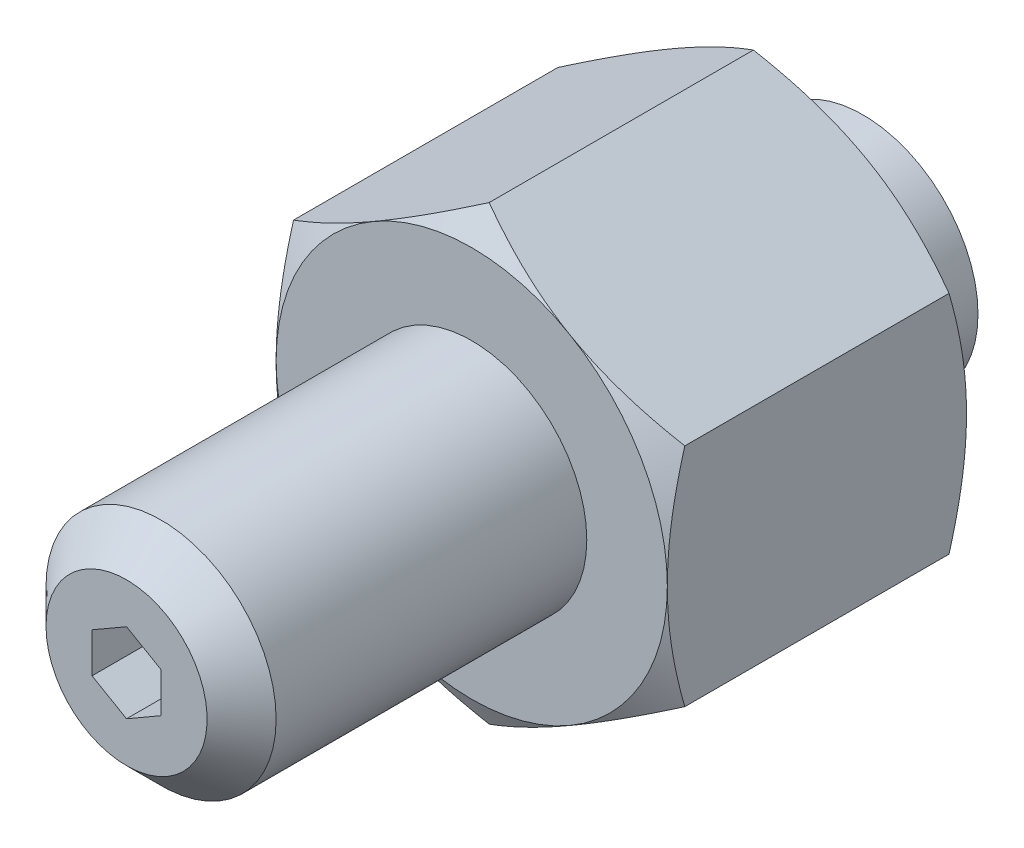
ISO-10303-21;
HEADER;
FILE_DESCRIPTION(('STEP AP214'),'2;1');
FILE_NAME('part.step','',(''),(''),'','','');
FILE_SCHEMA(('AUTOMOTIVE_DESIGN { 1 0 10303 214 1 1 1 1 }'));
ENDSEC;
DATA;
#1=APPLICATION_CONTEXT('core data for automotive mechanical design processes');
#2=APPLICATION_PROTOCOL_DEFINITION('international standard','automotive_design',2000,#1);
#3=PRODUCT_CONTEXT('',#1,'mechanical');
#4=PRODUCT('Part','Part','',(#3));
#5=PRODUCT_RELATED_PRODUCT_CATEGORY('part','',(#4));
#6=PRODUCT_DEFINITION_FORMATION('','',#4);
#7=PRODUCT_DEFINITION_CONTEXT('part definition',#1,'design');
#8=PRODUCT_DEFINITION('design','',#6,#7);
#9=PRODUCT_DEFINITION_SHAPE('','',#8);
#10=(LENGTH_UNIT() NAMED_UNIT(*) SI_UNIT(.MILLI.,.METRE.));
#11=(NAMED_UNIT(*) PLANE_ANGLE_UNIT() SI_UNIT($,.RADIAN.));
#12=(NAMED_UNIT(*) SI_UNIT($,.STERADIAN.) SOLID_ANGLE_UNIT());
#13=UNCERTAINTY_MEASURE_WITH_UNIT(LENGTH_MEASURE(1.E-05),#10,'distance_accuracy_value','');
#14=(GEOMETRIC_REPRESENTATION_CONTEXT(3) GLOBAL_UNCERTAINTY_ASSIGNED_CONTEXT((#13)) GLOBAL_UNIT_ASSIGNED_CONTEXT((#10,
#11,#12)) REPRESENTATION_CONTEXT('',''));
#15=CARTESIAN_POINT('',(0.,0.,0.));
#16=DIRECTION('',(0.,0.,1.));
#17=DIRECTION('',(1.,0.,0.));
#18=AXIS2_PLACEMENT_3D('',#15,#16,#17);
#19=CARTESIAN_POINT('',(0.,-9.81495457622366,42.));
#20=DIRECTION('',(-0.5,-0.866025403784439,0.));
#21=DIRECTION('',(-0.866025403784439,0.5,0.));
#22=AXIS2_PLACEMENT_3D('',#19,#20,#21);
#23=PLANE('',#22);
#24=DIRECTION('',(0.,0.,-1.));
#25=VECTOR('',#24,1.);
#26=CARTESIAN_POINT('',(-8.5,-4.90747728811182,42.));
#27=LINE('',#26,#25);
#28=CARTESIAN_POINT('',(-8.5,-4.90747728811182,16.2408106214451));
#29=VERTEX_POINT('',#28);
#30=CARTESIAN_POINT('',(-8.5,-4.90747728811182,4.75918937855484));
#31=VERTEX_POINT('',#30);
#32=EDGE_CURVE('E170',#29,#31,#27,.T.);
#33=ORIENTED_EDGE('',*,*,#32,.T.);
#34=CARTESIAN_POINT('',(-8.5002,-4.90736181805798,4.75925604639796));
#35=CARTESIAN_POINT('',(-8.31336077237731,-5.01523349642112,4.69698613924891));
#36=CARTESIAN_POINT('',(-8.1258249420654,-5.1235073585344,4.63754229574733));
#37=CARTESIAN_POINT('',(-7.74923024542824,-5.34093440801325,4.52508511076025));
#38=CARTESIAN_POINT('',(-7.56017075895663,-5.45008795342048,4.47207454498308));
#39=CARTESIAN_POINT('',(-6.9899652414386,-5.77929626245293,4.32373338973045));
#40=CARTESIAN_POINT('',(-6.60656835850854,-6.00065055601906,4.23935892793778));
#41=CARTESIAN_POINT('',(-6.03282233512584,-6.33190297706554,4.14042001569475));
#42=CARTESIAN_POINT('',(-5.84418723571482,-6.44081150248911,4.11223519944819));
#43=CARTESIAN_POINT('',(-5.4660639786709,-6.65912106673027,4.0649740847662));
#44=CARTESIAN_POINT('',(-5.27657589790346,-6.76852206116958,4.04589698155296));
#45=CARTESIAN_POINT('',(-4.8972734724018,-6.98751241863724,4.0173347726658));
#46=CARTESIAN_POINT('',(-4.70745974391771,-7.09710142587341,4.00783878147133));
#47=CARTESIAN_POINT('',(-4.32765694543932,-7.31638067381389,3.99864237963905));
#48=CARTESIAN_POINT('',(-4.13766788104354,-7.42607091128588,3.99894166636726));
#49=CARTESIAN_POINT('',(-3.78247698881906,-7.63114046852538,4.0086544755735));
#50=CARTESIAN_POINT('',(-3.6172500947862,-7.72653426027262,4.01688316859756));
#51=CARTESIAN_POINT('',(-3.28718328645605,-7.91709842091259,4.0405892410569));
#52=CARTESIAN_POINT('',(-3.12234339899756,-8.01226877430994,4.0560671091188));
#53=CARTESIAN_POINT('',(-2.62846189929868,-8.29741139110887,4.11300862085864));
#54=CARTESIAN_POINT('',(-2.30029449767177,-8.48687892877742,4.16497306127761));
#55=CARTESIAN_POINT('',(-1.64047857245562,-8.86782383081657,4.29488494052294));
#56=CARTESIAN_POINT('',(-1.30891425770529,-9.05925257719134,4.37338306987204));
#57=CARTESIAN_POINT('',(-0.650730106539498,-9.43925537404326,4.55154133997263));
#58=CARTESIAN_POINT('',(-0.324101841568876,-9.62783429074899,4.65115963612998));
#59=CARTESIAN_POINT('',(0.000200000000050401,-9.8150700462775,4.75925604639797));
#60=B_SPLINE_CURVE_WITH_KNOTS('',3,(#34,#35,#36,#37,#38,#39,#40,#41,#42,#43,#44,#45,#46,#47,#48,
#49,#50,#51,#52,#53,#54,#55,#56,#57,#58,#59),.UNSPECIFIED.,.F.,.F.,(4,2,2,2,2,2,2,2,2,2,2,2,4),
(0.,0.673596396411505,1.34748239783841,2.69805431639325,3.35679995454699,4.01548737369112,
4.67342558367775,5.33134346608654,5.90409556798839,6.47688628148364,7.62328361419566,
8.79510569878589,9.96462743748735),.UNSPECIFIED.);
#61=CARTESIAN_POINT('',(-4.25,-7.36121593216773,4.));
#62=VERTEX_POINT('',#61);
#63=EDGE_CURVE('E149',#31,#62,#60,.T.);
#64=ORIENTED_EDGE('',*,*,#63,.T.);
#65=CARTESIAN_POINT('',(0.,-9.81495457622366,4.75918937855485));
#66=VERTEX_POINT('',#65);
#67=EDGE_CURVE('E160',#62,#66,#60,.T.);
#68=ORIENTED_EDGE('',*,*,#67,.T.);
#69=DIRECTION('',(0.,0.,-1.));
#70=VECTOR('',#69,1.);
#71=CARTESIAN_POINT('',(0.,-9.81495457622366,42.));
#72=LINE('',#71,#70);
#73=CARTESIAN_POINT('',(0.,-9.81495457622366,16.2408106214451));
#74=VERTEX_POINT('',#73);
#75=EDGE_CURVE('E349',#74,#66,#72,.T.);
#76=ORIENTED_EDGE('',*,*,#75,.F.);
#77=CARTESIAN_POINT('',(0.000200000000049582,-9.8150700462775,16.240743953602));
#78=CARTESIAN_POINT('',(-0.186639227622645,-9.70719836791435,16.3030138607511));
#79=CARTESIAN_POINT('',(-0.374175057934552,-9.59892450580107,16.3624577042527));
#80=CARTESIAN_POINT('',(-0.750769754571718,-9.38149745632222,16.4749148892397));
#81=CARTESIAN_POINT('',(-0.939829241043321,-9.27234391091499,16.5279254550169));
#82=CARTESIAN_POINT('',(-1.51003475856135,-8.94313560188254,16.6762666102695));
#83=CARTESIAN_POINT('',(-1.89343164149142,-8.72178130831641,16.7606410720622));
#84=CARTESIAN_POINT('',(-2.46717766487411,-8.39052888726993,16.8595799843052));
#85=CARTESIAN_POINT('',(-2.65581276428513,-8.28162036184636,16.8877648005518));
#86=CARTESIAN_POINT('',(-3.03393602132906,-8.0633107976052,16.9350259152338));
#87=CARTESIAN_POINT('',(-3.22342410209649,-7.95390980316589,16.954103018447));
#88=CARTESIAN_POINT('',(-3.60272652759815,-7.73491944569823,16.9826652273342));
#89=CARTESIAN_POINT('',(-3.79254025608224,-7.62533043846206,16.9921612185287));
#90=CARTESIAN_POINT('',(-4.17234305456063,-7.40605119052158,17.0013576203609));
#91=CARTESIAN_POINT('',(-4.36233211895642,-7.29636095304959,17.0010583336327));
#92=CARTESIAN_POINT('',(-4.7175230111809,-7.09129139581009,16.9913455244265));
#93=CARTESIAN_POINT('',(-4.88274990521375,-6.99589760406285,16.9831168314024));
#94=CARTESIAN_POINT('',(-5.21281671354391,-6.80533344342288,16.9594107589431));
#95=CARTESIAN_POINT('',(-5.3776566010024,-6.71016309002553,16.9439328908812));
#96=CARTESIAN_POINT('',(-5.87153810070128,-6.42502047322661,16.8869913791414));
#97=CARTESIAN_POINT('',(-6.19970550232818,-6.23555293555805,16.8350269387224));
#98=CARTESIAN_POINT('',(-6.85952142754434,-5.8546080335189,16.7051150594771));
#99=CARTESIAN_POINT('',(-7.19108574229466,-5.66317928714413,16.626616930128));
#100=CARTESIAN_POINT('',(-7.84926989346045,-5.28317649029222,16.4484586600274));
#101=CARTESIAN_POINT('',(-8.17589815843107,-5.09459757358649,16.34884036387));
#102=CARTESIAN_POINT('',(-8.5002,-4.90736181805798,16.240743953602));
#103=B_SPLINE_CURVE_WITH_KNOTS('',3,(#77,#78,#79,#80,#81,#82,#83,#84,#85,#86,#87,#88,#89,#90,
#91,#92,#93,#94,#95,#96,#97,#98,#99,#100,#101,#102),.UNSPECIFIED.,.F.,.F.,(4,2,2,2,2,2,2,2,2,2,
2,2,4),(0.,0.673596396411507,1.34748239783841,2.69805431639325,3.35679995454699,
4.01548737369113,4.67342558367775,5.33134346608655,5.9040955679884,6.47688628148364,
7.62328361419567,8.79510569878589,9.96462743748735),.UNSPECIFIED.);
#104=CARTESIAN_POINT('',(-4.25,-7.36121593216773,17.));
#105=VERTEX_POINT('',#104);
#106=EDGE_CURVE('E347',#74,#105,#103,.T.);
#107=ORIENTED_EDGE('',*,*,#106,.T.);
#108=EDGE_CURVE('E235',#105,#29,#103,.T.);
#109=ORIENTED_EDGE('',*,*,#108,.T.);
#110=EDGE_LOOP('',(#33,#64,#68,#76,#107,#109));
#111=FACE_BOUND('',#110,.T.);
#112=ADVANCED_FACE('F14',(#111),#23,.T.);
#113=CARTESIAN_POINT('',(-8.5,-4.90747728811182,42.));
#114=DIRECTION('',(-1.,0.,0.));
#115=DIRECTION('',(0.,1.,0.));
#116=AXIS2_PLACEMENT_3D('',#113,#114,#115);
#117=PLANE('',#116);
#118=DIRECTION('',(0.,0.,-1.));
#119=VECTOR('',#118,1.);
#120=CARTESIAN_POINT('',(-8.5,4.90747728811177,42.));
#121=LINE('',#120,#119);
#122=CARTESIAN_POINT('',(-8.5,4.90747728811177,16.2408106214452));
#123=VERTEX_POINT('',#122);
#124=CARTESIAN_POINT('',(-8.5,4.90747728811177,4.75918937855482));
#125=VERTEX_POINT('',#124);
#126=EDGE_CURVE('E306',#123,#125,#121,.T.);
#127=ORIENTED_EDGE('',*,*,#126,.T.);
#128=CARTESIAN_POINT('',(-8.5,-13.1556973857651,8.13542736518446));
#129=CARTESIAN_POINT('',(-8.5,-12.7846738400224,7.95555394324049));
#130=CARTESIAN_POINT('',(-8.5,-12.4127957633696,7.77741284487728));
#131=CARTESIAN_POINT('',(-8.5,-11.6668760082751,7.42557009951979));
#132=CARTESIAN_POINT('',(-8.5,-11.2928339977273,7.25186915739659));
#133=CARTESIAN_POINT('',(-8.5,-10.5401919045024,6.90900196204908));
#134=CARTESIAN_POINT('',(-8.5,-10.1615780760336,6.73986577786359));
#135=CARTESIAN_POINT('',(-8.5,-9.40132994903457,6.4085501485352));
#136=CARTESIAN_POINT('',(-8.5,-9.01969579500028,6.24637037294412));
#137=CARTESIAN_POINT('',(-8.5,-8.24056904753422,5.92577227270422));
#138=CARTESIAN_POINT('',(-8.5,-7.84295868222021,5.76763857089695));
#139=CARTESIAN_POINT('',(-8.5,-7.04307735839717,5.46340328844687));
#140=CARTESIAN_POINT('',(-8.5,-6.64080588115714,5.31730306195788));
#141=CARTESIAN_POINT('',(-8.5,-5.8317190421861,5.04099004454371));
#142=CARTESIAN_POINT('',(-8.5,-5.42491486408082,4.91074485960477));
#143=CARTESIAN_POINT('',(-8.5,-4.6054858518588,4.67033698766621));
#144=CARTESIAN_POINT('',(-8.5,-4.19286290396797,4.56016794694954));
#145=CARTESIAN_POINT('',(-8.5,-3.3637863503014,4.36581070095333));
#146=CARTESIAN_POINT('',(-8.5,-2.94736656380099,4.28148213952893));
#147=CARTESIAN_POINT('',(-8.5,-2.31896593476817,4.17803188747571));
#148=CARTESIAN_POINT('',(-8.5,-2.108854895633,4.14738748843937));
#149=CARTESIAN_POINT('',(-8.5,-1.68759745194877,4.09438123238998));
#150=CARTESIAN_POINT('',(-8.5,-1.47645114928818,4.07201857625));
#151=CARTESIAN_POINT('',(-8.5,-1.05615241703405,4.03630039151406));
#152=CARTESIAN_POINT('',(-8.5,-0.847009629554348,4.02283184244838));
#153=CARTESIAN_POINT('',(-8.5,-0.428342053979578,4.00474919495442));
#154=CARTESIAN_POINT('',(-8.5,-0.218817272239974,4.00013495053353));
#155=CARTESIAN_POINT('',(-8.5,0.200239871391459,3.99987090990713));
#156=CARTESIAN_POINT('',(-8.5,0.409772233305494,4.0042211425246));
#157=CARTESIAN_POINT('',(-8.5,0.828468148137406,4.02178018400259));
#158=CARTESIAN_POINT('',(-8.5,1.03763168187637,4.03498944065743));
#159=CARTESIAN_POINT('',(-8.5,1.54113057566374,4.07717116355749));
#160=CARTESIAN_POINT('',(-8.5,1.83511742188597,4.1103922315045));
#161=CARTESIAN_POINT('',(-8.5,2.42087783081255,4.19251685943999));
#162=CARTESIAN_POINT('',(-8.5,2.71265108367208,4.24142257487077));
#163=CARTESIAN_POINT('',(-8.5,3.58433543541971,4.40907076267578));
#164=CARTESIAN_POINT('',(-8.5,4.16027843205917,4.54871274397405));
#165=CARTESIAN_POINT('',(-8.5,5.02140429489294,4.79046647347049));
#166=CARTESIAN_POINT('',(-8.5,5.31106424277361,4.87754478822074));
#167=CARTESIAN_POINT('',(-8.5,5.88757021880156,5.06064792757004));
#168=CARTESIAN_POINT('',(-8.5,6.1744162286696,5.15667281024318));
#169=CARTESIAN_POINT('',(-8.5,6.74538616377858,5.35613658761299));
#170=CARTESIAN_POINT('',(-8.5,7.02951097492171,5.45957296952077));
#171=CARTESIAN_POINT('',(-8.5,7.59541345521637,5.67265251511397));
#172=CARTESIAN_POINT('',(-8.5,7.87719114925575,5.78229561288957));
#173=CARTESIAN_POINT('',(-8.5,8.53126792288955,6.04377884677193));
#174=CARTESIAN_POINT('',(-8.5,8.90276984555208,6.19760904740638));
#175=CARTESIAN_POINT('',(-8.5,9.64269611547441,6.5125216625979));
#176=CARTESIAN_POINT('',(-8.5,10.0111202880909,6.67360448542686));
#177=CARTESIAN_POINT('',(-8.5,10.7454491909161,7.00160100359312));
#178=CARTESIAN_POINT('',(-8.5,11.1113533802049,7.16851590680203));
#179=CARTESIAN_POINT('',(-8.5,11.840976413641,7.50702620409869));
#180=CARTESIAN_POINT('',(-8.5,12.2046953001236,7.67862150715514));
#181=CARTESIAN_POINT('',(-8.5,12.9306788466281,8.02581349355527));
#182=CARTESIAN_POINT('',(-8.5,13.2929416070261,8.20141414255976));
#183=CARTESIAN_POINT('',(-8.5,14.0159186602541,8.55577753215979));
#184=CARTESIAN_POINT('',(-8.5,14.3766329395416,8.73454030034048));
#185=CARTESIAN_POINT('',(-8.5,15.4567256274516,9.27470179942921));
#186=CARTESIAN_POINT('',(-8.5,16.174144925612,9.64001761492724));
#187=CARTESIAN_POINT('',(-8.5,17.5468942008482,10.3479916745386));
#188=CARTESIAN_POINT('',(-8.5,18.2025231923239,10.6900726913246));
#189=CARTESIAN_POINT('',(-8.5,19.5113214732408,11.3789567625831));
#190=CARTESIAN_POINT('',(-8.50000000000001,20.1644906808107,11.7257599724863));
#191=CARTESIAN_POINT('',(-8.50000000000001,21.4673424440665,12.4221405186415));
#192=CARTESIAN_POINT('',(-8.50000000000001,22.1170296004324,12.7717092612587));
#193=CARTESIAN_POINT('',(-8.50000000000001,23.4148243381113,13.4736861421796));
#194=CARTESIAN_POINT('',(-8.5,24.0629320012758,13.8260941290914));
#195=CARTESIAN_POINT('',(-8.5,24.7104551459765,14.1795656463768));
#196=B_SPLINE_CURVE_WITH_KNOTS('',3,(#128,#129,#130,#131,#132,#133,#134,#135,#136,#137,#138,
#139,#140,#141,#142,#143,#144,#145,#146,#147,#148,#149,#150,#151,#152,#153,#154,#155,#156,#157,
#158,#159,#160,#161,#162,#163,#164,#165,#166,#167,#168,#169,#170,#171,#172,#173,#174,#175,#176,
#177,#178,#179,#180,#181,#182,#183,#184,#185,#186,#187,#188,#189,#190,#191,#192,#193,#194,#195),
.UNSPECIFIED.,.F.,.F.,(4,2,2,2,2,2,2,2,2,2,2,2,2,2,2,2,2,2,2,2,2,2,2,2,2,2,2,2,2,2,2,2,2,4),(0.,
1.23699391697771,2.47418300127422,3.71815238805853,4.96206261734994,6.24561802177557,
7.52931767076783,8.81034888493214,10.0909739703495,11.3645145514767,12.0013790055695,
12.6381819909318,13.2667286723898,13.8952649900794,14.5238033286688,15.1523734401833,
16.0394453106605,16.9266391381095,18.7020248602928,19.6093475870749,20.5166762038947,
21.4236986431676,22.3307114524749,23.5368827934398,24.7431221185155,25.9496127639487,
27.1560799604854,28.3637985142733,29.5715276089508,31.9866826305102,34.205179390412,
36.4237493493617,38.6370256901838,40.8501847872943),.UNSPECIFIED.);
#197=CARTESIAN_POINT('',(-8.5,0.,4.));
#198=VERTEX_POINT('',#197);
#199=EDGE_CURVE('E289',#125,#198,#196,.F.);
#200=ORIENTED_EDGE('',*,*,#199,.T.);
#201=EDGE_CURVE('E151',#198,#31,#196,.F.);
#202=ORIENTED_EDGE('',*,*,#201,.T.);
#203=ORIENTED_EDGE('',*,*,#32,.F.);
#204=CARTESIAN_POINT('',(-8.5,-13.1556973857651,12.8645726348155));
#205=CARTESIAN_POINT('',(-8.5,-12.7846738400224,13.0444460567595));
#206=CARTESIAN_POINT('',(-8.5,-12.4127957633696,13.2225871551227));
#207=CARTESIAN_POINT('',(-8.5,-11.6668760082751,13.5744299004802));
#208=CARTESIAN_POINT('',(-8.5,-11.2928339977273,13.7481308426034));
#209=CARTESIAN_POINT('',(-8.5,-10.5401919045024,14.0909980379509));
#210=CARTESIAN_POINT('',(-8.5,-10.1615780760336,14.2601342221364));
#211=CARTESIAN_POINT('',(-8.5,-9.40132994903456,14.5914498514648));
#212=CARTESIAN_POINT('',(-8.5,-9.01969579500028,14.7536296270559));
#213=CARTESIAN_POINT('',(-8.5,-8.24056904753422,15.0742277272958));
#214=CARTESIAN_POINT('',(-8.5,-7.84295868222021,15.232361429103));
#215=CARTESIAN_POINT('',(-8.5,-7.04307735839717,15.5365967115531));
#216=CARTESIAN_POINT('',(-8.5,-6.64080588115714,15.6826969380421));
#217=CARTESIAN_POINT('',(-8.5,-5.83171904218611,15.9590099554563));
#218=CARTESIAN_POINT('',(-8.5,-5.42491486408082,16.0892551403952));
#219=CARTESIAN_POINT('',(-8.5,-4.60548585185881,16.3296630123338));
#220=CARTESIAN_POINT('',(-8.5,-4.19286290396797,16.4398320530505));
#221=CARTESIAN_POINT('',(-8.5,-3.3637863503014,16.6341892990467));
#222=CARTESIAN_POINT('',(-8.5,-2.94736656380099,16.7185178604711));
#223=CARTESIAN_POINT('',(-8.5,-2.31896593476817,16.8219681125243));
#224=CARTESIAN_POINT('',(-8.5,-2.108854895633,16.8526125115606));
#225=CARTESIAN_POINT('',(-8.5,-1.68759745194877,16.90561876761));
#226=CARTESIAN_POINT('',(-8.5,-1.47645114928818,16.92798142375));
#227=CARTESIAN_POINT('',(-8.5,-1.05615241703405,16.9636996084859));
#228=CARTESIAN_POINT('',(-8.5,-0.847009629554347,16.9771681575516));
#229=CARTESIAN_POINT('',(-8.5,-0.428342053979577,16.9952508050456));
#230=CARTESIAN_POINT('',(-8.5,-0.218817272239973,16.9998650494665));
#231=CARTESIAN_POINT('',(-8.5,0.200239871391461,17.0001290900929));
#232=CARTESIAN_POINT('',(-8.5,0.409772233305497,16.9957788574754));
#233=CARTESIAN_POINT('',(-8.5,0.828468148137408,16.9782198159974));
#234=CARTESIAN_POINT('',(-8.5,1.03763168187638,16.9650105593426));
#235=CARTESIAN_POINT('',(-8.5,1.54113057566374,16.9228288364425));
#236=CARTESIAN_POINT('',(-8.5,1.83511742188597,16.8896077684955));
#237=CARTESIAN_POINT('',(-8.5,2.42087783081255,16.80748314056));
#238=CARTESIAN_POINT('',(-8.5,2.71265108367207,16.7585774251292));
#239=CARTESIAN_POINT('',(-8.5,3.5843354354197,16.5909292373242));
#240=CARTESIAN_POINT('',(-8.5,4.16027843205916,16.4512872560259));
#241=CARTESIAN_POINT('',(-8.5,5.02140429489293,16.2095335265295));
#242=CARTESIAN_POINT('',(-8.5,5.3110642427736,16.1224552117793));
#243=CARTESIAN_POINT('',(-8.5,5.88757021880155,15.93935207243));
#244=CARTESIAN_POINT('',(-8.5,6.17441622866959,15.8433271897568));
#245=CARTESIAN_POINT('',(-8.5,6.74538616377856,15.643863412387));
#246=CARTESIAN_POINT('',(-8.5,7.0295109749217,15.5404270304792));
#247=CARTESIAN_POINT('',(-8.5,7.59541345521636,15.327347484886));
#248=CARTESIAN_POINT('',(-8.5,7.87719114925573,15.2177043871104));
#249=CARTESIAN_POINT('',(-8.5,8.53126792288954,14.9562211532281));
#250=CARTESIAN_POINT('',(-8.5,8.90276984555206,14.8023909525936));
#251=CARTESIAN_POINT('',(-8.5,9.64269611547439,14.4874783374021));
#252=CARTESIAN_POINT('',(-8.5,10.0111202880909,14.3263955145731));
#253=CARTESIAN_POINT('',(-8.5,10.7454491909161,13.9983989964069));
#254=CARTESIAN_POINT('',(-8.5,11.1113533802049,13.8314840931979));
#255=CARTESIAN_POINT('',(-8.5,11.840976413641,13.4929737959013));
#256=CARTESIAN_POINT('',(-8.5,12.2046953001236,13.3213784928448));
#257=CARTESIAN_POINT('',(-8.5,12.9306788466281,12.9741865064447));
#258=CARTESIAN_POINT('',(-8.5,13.2929416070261,12.7985858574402));
#259=CARTESIAN_POINT('',(-8.5,14.0159186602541,12.4442224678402));
#260=CARTESIAN_POINT('',(-8.5,14.3766329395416,12.2654596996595));
#261=CARTESIAN_POINT('',(-8.5,15.4567256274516,11.7252982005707));
#262=CARTESIAN_POINT('',(-8.5,16.174144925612,11.3599823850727));
#263=CARTESIAN_POINT('',(-8.5,17.5468942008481,10.6520083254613));
#264=CARTESIAN_POINT('',(-8.5,18.2025231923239,10.3099273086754));
#265=CARTESIAN_POINT('',(-8.5,19.5113214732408,9.62104323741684));
#266=CARTESIAN_POINT('',(-8.50000000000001,20.1644906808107,9.27424002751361));
#267=CARTESIAN_POINT('',(-8.50000000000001,21.4673424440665,8.57785948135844));
#268=CARTESIAN_POINT('',(-8.50000000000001,22.1170296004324,8.22829073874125));
#269=CARTESIAN_POINT('',(-8.50000000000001,23.4148243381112,7.5263138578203));
#270=CARTESIAN_POINT('',(-8.5,24.0629320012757,7.17390587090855));
#271=CARTESIAN_POINT('',(-8.5,24.7104551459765,6.82043435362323));
#272=B_SPLINE_CURVE_WITH_KNOTS('',3,(#204,#205,#206,#207,#208,#209,#210,#211,#212,#213,#214,
#215,#216,#217,#218,#219,#220,#221,#222,#223,#224,#225,#226,#227,#228,#229,#230,#231,#232,#233,
#234,#235,#236,#237,#238,#239,#240,#241,#242,#243,#244,#245,#246,#247,#248,#249,#250,#251,#252,
#253,#254,#255,#256,#257,#258,#259,#260,#261,#262,#263,#264,#265,#266,#267,#268,#269,#270,#271),
.UNSPECIFIED.,.F.,.F.,(4,2,2,2,2,2,2,2,2,2,2,2,2,2,2,2,2,2,2,2,2,2,2,2,2,2,2,2,2,2,2,2,2,4),(0.,
1.23699391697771,2.47418300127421,3.71815238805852,4.96206261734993,6.24561802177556,
7.52931767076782,8.81034888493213,10.0909739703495,11.3645145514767,12.0013790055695,
12.6381819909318,13.2667286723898,13.8952649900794,14.5238033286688,15.1523734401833,
16.0394453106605,16.9266391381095,18.7020248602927,19.6093475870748,20.5166762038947,
21.4236986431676,22.3307114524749,23.5368827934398,24.7431221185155,25.9496127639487,
27.1560799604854,28.3637985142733,29.5715276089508,31.9866826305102,34.205179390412,
36.4237493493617,38.6370256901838,40.8501847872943),.UNSPECIFIED.);
#273=CARTESIAN_POINT('',(-8.5,0.,17.));
#274=VERTEX_POINT('',#273);
#275=EDGE_CURVE('E245',#29,#274,#272,.T.);
#276=ORIENTED_EDGE('',*,*,#275,.T.);
#277=EDGE_CURVE('E265',#274,#123,#272,.T.);
#278=ORIENTED_EDGE('',*,*,#277,.T.);
#279=EDGE_LOOP('',(#127,#200,#202,#203,#276,#278));
#280=FACE_BOUND('',#279,.T.);
#281=ADVANCED_FACE('F269',(#280),#117,.T.);
#282=CARTESIAN_POINT('',(0.,9.81495457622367,42.));
#283=DIRECTION('',(0.500000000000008,-0.866025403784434,0.));
#284=DIRECTION('',(-0.866025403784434,-0.500000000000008,0.));
#285=AXIS2_PLACEMENT_3D('',#282,#283,#284);
#286=PLANE('',#285);
#287=CARTESIAN_POINT('',(-8.5002,4.90736181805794,4.75925604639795));
#288=CARTESIAN_POINT('',(-8.31336077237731,5.01523349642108,4.6969861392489));
#289=CARTESIAN_POINT('',(-8.1258249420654,5.12350735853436,4.63754229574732));
#290=CARTESIAN_POINT('',(-7.74923024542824,5.34093440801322,4.52508511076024));
#291=CARTESIAN_POINT('',(-7.56017075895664,5.45008795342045,4.47207454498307));
#292=CARTESIAN_POINT('',(-6.98996524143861,5.7792962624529,4.32373338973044));
#293=CARTESIAN_POINT('',(-6.60656835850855,6.00065055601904,4.23935892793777));
#294=CARTESIAN_POINT('',(-6.03282233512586,6.33190297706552,4.14042001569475));
#295=CARTESIAN_POINT('',(-5.84418723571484,6.44081150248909,4.11223519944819));
#296=CARTESIAN_POINT('',(-5.46606397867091,6.65912106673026,4.0649740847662));
#297=CARTESIAN_POINT('',(-5.27657589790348,6.76852206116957,4.04589698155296));
#298=CARTESIAN_POINT('',(-4.89727347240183,6.98751241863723,4.01733477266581));
#299=CARTESIAN_POINT('',(-4.70745974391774,7.09710142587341,4.00783878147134));
#300=CARTESIAN_POINT('',(-4.32765694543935,7.31638067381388,3.99864237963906));
#301=CARTESIAN_POINT('',(-4.13766788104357,7.42607091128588,3.99894166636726));
#302=CARTESIAN_POINT('',(-3.78247698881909,7.63114046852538,4.00865447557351));
#303=CARTESIAN_POINT('',(-3.61725009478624,7.72653426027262,4.01688316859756));
#304=CARTESIAN_POINT('',(-3.28718328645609,7.91709842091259,4.04058924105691));
#305=CARTESIAN_POINT('',(-3.1223433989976,8.01226877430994,4.05606710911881));
#306=CARTESIAN_POINT('',(-2.62846189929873,8.29741139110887,4.11300862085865));
#307=CARTESIAN_POINT('',(-2.30029449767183,8.48687892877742,4.16497306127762));
#308=CARTESIAN_POINT('',(-1.64047857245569,8.86782383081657,4.29488494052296));
#309=CARTESIAN_POINT('',(-1.30891425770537,9.05925257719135,4.37338306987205));
#310=CARTESIAN_POINT('',(-0.650730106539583,9.43925537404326,4.55154133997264));
#311=CARTESIAN_POINT('',(-0.324101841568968,9.627834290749,4.65115963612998));
#312=CARTESIAN_POINT('',(0.000199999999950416,9.81507004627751,4.75925604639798));
#313=B_SPLINE_CURVE_WITH_KNOTS('',3,(#287,#288,#289,#290,#291,#292,#293,#294,#295,#296,#297,
#298,#299,#300,#301,#302,#303,#304,#305,#306,#307,#308,#309,#310,#311,#312),.UNSPECIFIED.,.F.,
.F.,(4,2,2,2,2,2,2,2,2,2,2,2,4),(0.,0.673596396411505,1.34748239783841,2.69805431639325,
3.35679995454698,4.01548737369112,4.67342558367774,5.33134346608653,5.90409556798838,
6.47688628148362,7.62328361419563,8.79510569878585,9.96462743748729),.UNSPECIFIED.);
#314=CARTESIAN_POINT('',(-4.25000000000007,7.3612159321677,4.));
#315=VERTEX_POINT('',#314);
#316=EDGE_CURVE('E280',#125,#315,#313,.T.);
#317=ORIENTED_EDGE('',*,*,#316,.F.);
#318=ORIENTED_EDGE('',*,*,#126,.F.);
#319=CARTESIAN_POINT('',(0.00019999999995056,9.81507004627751,16.240743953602));
#320=CARTESIAN_POINT('',(-0.186639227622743,9.70719836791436,16.3030138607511));
#321=CARTESIAN_POINT('',(-0.374175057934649,9.59892450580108,16.3624577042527));
#322=CARTESIAN_POINT('',(-0.750769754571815,9.38149745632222,16.4749148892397));
#323=CARTESIAN_POINT('',(-0.939829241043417,9.27234391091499,16.5279254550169));
#324=CARTESIAN_POINT('',(-1.51003475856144,8.94313560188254,16.6762666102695));
#325=CARTESIAN_POINT('',(-1.89343164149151,8.72178130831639,16.7606410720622));
#326=CARTESIAN_POINT('',(-2.4671776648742,8.39052888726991,16.8595799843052));
#327=CARTESIAN_POINT('',(-2.65581276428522,8.28162036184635,16.8877648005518));
#328=CARTESIAN_POINT('',(-3.03393602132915,8.06331079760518,16.9350259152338));
#329=CARTESIAN_POINT('',(-3.22342410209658,7.95390980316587,16.954103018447));
#330=CARTESIAN_POINT('',(-3.60272652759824,7.73491944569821,16.9826652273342));
#331=CARTESIAN_POINT('',(-3.79254025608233,7.62533043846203,16.9921612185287));
#332=CARTESIAN_POINT('',(-4.17234305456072,7.40605119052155,17.0013576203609));
#333=CARTESIAN_POINT('',(-4.3623321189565,7.29636095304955,17.0010583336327));
#334=CARTESIAN_POINT('',(-4.71752301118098,7.09129139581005,16.9913455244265));
#335=CARTESIAN_POINT('',(-4.88274990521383,6.99589760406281,16.9831168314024));
#336=CARTESIAN_POINT('',(-5.21281671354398,6.80533344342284,16.9594107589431));
#337=CARTESIAN_POINT('',(-5.37765660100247,6.71016309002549,16.9439328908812));
#338=CARTESIAN_POINT('',(-5.87153810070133,6.42502047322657,16.8869913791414));
#339=CARTESIAN_POINT('',(-6.19970550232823,6.23555293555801,16.8350269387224));
#340=CARTESIAN_POINT('',(-6.85952142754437,5.85460803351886,16.7051150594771));
#341=CARTESIAN_POINT('',(-7.19108574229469,5.66317928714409,16.626616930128));
#342=CARTESIAN_POINT('',(-7.84926989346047,5.28317649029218,16.4484586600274));
#343=CARTESIAN_POINT('',(-8.17589815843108,5.09459757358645,16.34884036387));
#344=CARTESIAN_POINT('',(-8.5002,4.90736181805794,16.240743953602));
#345=B_SPLINE_CURVE_WITH_KNOTS('',3,(#319,#320,#321,#322,#323,#324,#325,#326,#327,#328,#329,
#330,#331,#332,#333,#334,#335,#336,#337,#338,#339,#340,#341,#342,#343,#344),.UNSPECIFIED.,.F.,
.F.,(4,2,2,2,2,2,2,2,2,2,2,2,4),(0.,0.673596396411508,1.34748239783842,2.69805431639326,
3.356799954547,4.01548737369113,4.67342558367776,5.33134346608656,5.9040955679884,
6.47688628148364,7.62328361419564,8.79510569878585,9.96462743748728),.UNSPECIFIED.);
#346=CARTESIAN_POINT('',(-4.25000000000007,7.3612159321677,17.));
#347=VERTEX_POINT('',#346);
#348=EDGE_CURVE('E259',#347,#123,#345,.T.);
#349=ORIENTED_EDGE('',*,*,#348,.F.);
#350=CARTESIAN_POINT('',(0.,9.81495457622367,16.2408106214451));
#351=VERTEX_POINT('',#350);
#352=EDGE_CURVE('E264',#351,#347,#345,.T.);
#353=ORIENTED_EDGE('',*,*,#352,.F.);
#354=DIRECTION('',(0.,0.,-1.));
#355=VECTOR('',#354,1.);
#356=CARTESIAN_POINT('',(0.,9.81495457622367,42.));
#357=LINE('',#356,#355);
#358=CARTESIAN_POINT('',(0.,9.81495457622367,4.75918937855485));
#359=VERTEX_POINT('',#358);
#360=EDGE_CURVE('E314',#351,#359,#357,.T.);
#361=ORIENTED_EDGE('',*,*,#360,.T.);
#362=EDGE_CURVE('E274',#315,#359,#313,.T.);
#363=ORIENTED_EDGE('',*,*,#362,.F.);
#364=EDGE_LOOP('',(#317,#318,#349,#353,#361,#363));
#365=FACE_BOUND('',#364,.T.);
#366=ADVANCED_FACE('F266',(#365),#286,.F.);
#367=CARTESIAN_POINT('',(0.,9.81495457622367,42.));
#368=DIRECTION('',(0.5,0.866025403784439,0.));
#369=DIRECTION('',(0.866025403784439,-0.5,0.));
#370=AXIS2_PLACEMENT_3D('',#367,#368,#369);
#371=PLANE('',#370);
#372=DIRECTION('',(0.,0.,-1.));
#373=VECTOR('',#372,1.);
#374=CARTESIAN_POINT('',(8.5,4.90747728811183,42.));
#375=LINE('',#374,#373);
#376=CARTESIAN_POINT('',(8.5,4.90747728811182,16.2408106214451));
#377=VERTEX_POINT('',#376);
#378=CARTESIAN_POINT('',(8.5,4.90747728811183,4.75918937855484));
#379=VERTEX_POINT('',#378);
#380=EDGE_CURVE('E326',#377,#379,#375,.T.);
#381=ORIENTED_EDGE('',*,*,#380,.T.);
#382=CARTESIAN_POINT('',(8.5002,4.90736181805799,4.75925604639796));
#383=CARTESIAN_POINT('',(8.31336077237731,5.01523349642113,4.69698613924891));
#384=CARTESIAN_POINT('',(8.1258249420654,5.12350735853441,4.63754229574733));
#385=CARTESIAN_POINT('',(7.74923024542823,5.34093440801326,4.52508511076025));
#386=CARTESIAN_POINT('',(7.56017075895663,5.45008795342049,4.47207454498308));
#387=CARTESIAN_POINT('',(6.9899652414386,5.77929626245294,4.32373338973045));
#388=CARTESIAN_POINT('',(6.60656835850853,6.00065055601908,4.23935892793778));
#389=CARTESIAN_POINT('',(6.03282233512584,6.33190297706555,4.14042001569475));
#390=CARTESIAN_POINT('',(5.84418723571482,6.44081150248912,4.1122351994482));
#391=CARTESIAN_POINT('',(5.46606397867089,6.65912106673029,4.0649740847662));
#392=CARTESIAN_POINT('',(5.27657589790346,6.76852206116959,4.04589698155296));
#393=CARTESIAN_POINT('',(4.8972734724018,6.98751241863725,4.01733477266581));
#394=CARTESIAN_POINT('',(4.70745974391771,7.09710142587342,4.00783878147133));
#395=CARTESIAN_POINT('',(4.32765694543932,7.3163806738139,3.99864237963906));
#396=CARTESIAN_POINT('',(4.13766788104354,7.42607091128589,3.99894166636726));
#397=CARTESIAN_POINT('',(3.78247698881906,7.63114046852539,4.00865447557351));
#398=CARTESIAN_POINT('',(3.6172500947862,7.72653426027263,4.01688316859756));
#399=CARTESIAN_POINT('',(3.28718328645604,7.9170984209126,4.04058924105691));
#400=CARTESIAN_POINT('',(3.12234339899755,8.01226877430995,4.05606710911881));
#401=CARTESIAN_POINT('',(2.62846189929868,8.29741139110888,4.11300862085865));
#402=CARTESIAN_POINT('',(2.30029449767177,8.48687892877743,4.16497306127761));
#403=CARTESIAN_POINT('',(1.64047857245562,8.86782383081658,4.29488494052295));
#404=CARTESIAN_POINT('',(1.30891425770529,9.05925257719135,4.37338306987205));
#405=CARTESIAN_POINT('',(0.650730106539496,9.43925537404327,4.55154133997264));
#406=CARTESIAN_POINT('',(0.324101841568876,9.627834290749,4.65115963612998));
#407=CARTESIAN_POINT('',(-0.000200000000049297,9.81507004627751,4.75925604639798));
#408=B_SPLINE_CURVE_WITH_KNOTS('',3,(#382,#383,#384,#385,#386,#387,#388,#389,#390,#391,#392,
#393,#394,#395,#396,#397,#398,#399,#400,#401,#402,#403,#404,#405,#406,#407),.UNSPECIFIED.,.F.,
.F.,(4,2,2,2,2,2,2,2,2,2,2,2,4),(0.,0.673596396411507,1.34748239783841,2.69805431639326,
3.35679995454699,4.01548737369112,4.67342558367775,5.33134346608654,5.90409556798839,
6.47688628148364,7.62328361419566,8.79510569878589,9.96462743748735),.UNSPECIFIED.);
#409=CARTESIAN_POINT('',(4.25,7.36121593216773,4.));
#410=VERTEX_POINT('',#409);
#411=EDGE_CURVE('E165',#379,#410,#408,.T.);
#412=ORIENTED_EDGE('',*,*,#411,.T.);
#413=EDGE_CURVE('E171',#410,#359,#408,.T.);
#414=ORIENTED_EDGE('',*,*,#413,.T.);
#415=ORIENTED_EDGE('',*,*,#360,.F.);
#416=CARTESIAN_POINT('',(-0.000200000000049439,9.81507004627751,16.240743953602));
#417=CARTESIAN_POINT('',(0.186639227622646,9.70719836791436,16.3030138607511));
#418=CARTESIAN_POINT('',(0.374175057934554,9.59892450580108,16.3624577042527));
#419=CARTESIAN_POINT('',(0.750769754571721,9.38149745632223,16.4749148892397));
#420=CARTESIAN_POINT('',(0.939829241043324,9.27234391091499,16.5279254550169));
#421=CARTESIAN_POINT('',(1.51003475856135,8.94313560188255,16.6762666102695));
#422=CARTESIAN_POINT('',(1.89343164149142,8.72178130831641,16.7606410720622));
#423=CARTESIAN_POINT('',(2.46717766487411,8.39052888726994,16.8595799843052));
#424=CARTESIAN_POINT('',(2.65581276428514,8.28162036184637,16.8877648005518));
#425=CARTESIAN_POINT('',(3.03393602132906,8.0633107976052,16.9350259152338));
#426=CARTESIAN_POINT('',(3.2234241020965,7.9539098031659,16.954103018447));
#427=CARTESIAN_POINT('',(3.60272652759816,7.73491944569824,16.9826652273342));
#428=CARTESIAN_POINT('',(3.79254025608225,7.62533043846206,16.9921612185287));
#429=CARTESIAN_POINT('',(4.17234305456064,7.40605119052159,17.0013576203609));
#430=CARTESIAN_POINT('',(4.36233211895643,7.2963609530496,17.0010583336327));
#431=CARTESIAN_POINT('',(4.71752301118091,7.0912913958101,16.9913455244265));
#432=CARTESIAN_POINT('',(4.88274990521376,6.99589760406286,16.9831168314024));
#433=CARTESIAN_POINT('',(5.21281671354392,6.80533344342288,16.9594107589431));
#434=CARTESIAN_POINT('',(5.37765660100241,6.71016309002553,16.9439328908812));
#435=CARTESIAN_POINT('',(5.87153810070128,6.42502047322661,16.8869913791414));
#436=CARTESIAN_POINT('',(6.19970550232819,6.23555293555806,16.8350269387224));
#437=CARTESIAN_POINT('',(6.85952142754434,5.85460803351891,16.7051150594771));
#438=CARTESIAN_POINT('',(7.19108574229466,5.66317928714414,16.626616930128));
#439=CARTESIAN_POINT('',(7.84926989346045,5.28317649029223,16.4484586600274));
#440=CARTESIAN_POINT('',(8.17589815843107,5.0945975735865,16.34884036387));
#441=CARTESIAN_POINT('',(8.5002,4.90736181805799,16.240743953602));
#442=B_SPLINE_CURVE_WITH_KNOTS('',3,(#416,#417,#418,#419,#420,#421,#422,#423,#424,#425,#426,
#427,#428,#429,#430,#431,#432,#433,#434,#435,#436,#437,#438,#439,#440,#441),.UNSPECIFIED.,.F.,
.F.,(4,2,2,2,2,2,2,2,2,2,2,2,4),(0.,0.673596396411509,1.34748239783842,2.69805431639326,
3.356799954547,4.01548737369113,4.67342558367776,5.33134346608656,5.90409556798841,
6.47688628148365,7.62328361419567,8.79510569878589,9.96462743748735),.UNSPECIFIED.);
#443=CARTESIAN_POINT('',(4.25,7.36121593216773,17.));
#444=VERTEX_POINT('',#443);
#445=EDGE_CURVE('E215',#351,#444,#442,.T.);
#446=ORIENTED_EDGE('',*,*,#445,.T.);
#447=EDGE_CURVE('E214',#444,#377,#442,.T.);
#448=ORIENTED_EDGE('',*,*,#447,.T.);
#449=EDGE_LOOP('',(#381,#412,#414,#415,#446,#448));
#450=FACE_BOUND('',#449,.T.);
#451=ADVANCED_FACE('F199',(#450),#371,.T.);
#452=CARTESIAN_POINT('',(8.5,-4.90747728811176,42.));
#453=DIRECTION('',(-1.,0.,0.));
#454=DIRECTION('',(0.,0.,-1.));
#455=AXIS2_PLACEMENT_3D('',#452,#453,#454);
#456=PLANE('',#455);
#457=CARTESIAN_POINT('',(8.5,-13.155697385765,8.13542736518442));
#458=CARTESIAN_POINT('',(8.5,-12.7846738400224,7.95555394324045));
#459=CARTESIAN_POINT('',(8.5,-12.4127957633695,7.77741284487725));
#460=CARTESIAN_POINT('',(8.5,-11.666876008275,7.42557009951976));
#461=CARTESIAN_POINT('',(8.5,-11.2928339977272,7.25186915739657));
#462=CARTESIAN_POINT('',(8.5,-10.5401919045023,6.90900196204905));
#463=CARTESIAN_POINT('',(8.5,-10.1615780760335,6.73986577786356));
#464=CARTESIAN_POINT('',(8.5,-9.4013299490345,6.40855014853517));
#465=CARTESIAN_POINT('',(8.5,-9.01969579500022,6.24637037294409));
#466=CARTESIAN_POINT('',(8.5,-8.24056904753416,5.9257722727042));
#467=CARTESIAN_POINT('',(8.5,-7.84295868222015,5.76763857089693));
#468=CARTESIAN_POINT('',(8.5,-7.04307735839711,5.46340328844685));
#469=CARTESIAN_POINT('',(8.5,-6.64080588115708,5.31730306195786));
#470=CARTESIAN_POINT('',(8.5,-5.83171904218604,5.04099004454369));
#471=CARTESIAN_POINT('',(8.5,-5.42491486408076,4.91074485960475));
#472=CARTESIAN_POINT('',(8.5,-4.60548585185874,4.6703369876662));
#473=CARTESIAN_POINT('',(8.5,-4.19286290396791,4.56016794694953));
#474=CARTESIAN_POINT('',(8.5,-3.36378635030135,4.36581070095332));
#475=CARTESIAN_POINT('',(8.5,-2.94736656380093,4.28148213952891));
#476=CARTESIAN_POINT('',(8.5,-2.31896593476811,4.17803188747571));
#477=CARTESIAN_POINT('',(8.5,-2.10885489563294,4.14738748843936));
#478=CARTESIAN_POINT('',(8.5,-1.68759745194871,4.09438123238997));
#479=CARTESIAN_POINT('',(8.5,-1.47645114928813,4.07201857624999));
#480=CARTESIAN_POINT('',(8.5,-1.056152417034,4.03630039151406));
#481=CARTESIAN_POINT('',(8.5,-0.847009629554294,4.02283184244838));
#482=CARTESIAN_POINT('',(8.5,-0.428342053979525,4.00474919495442));
#483=CARTESIAN_POINT('',(8.5,-0.218817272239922,4.00013495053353));
#484=CARTESIAN_POINT('',(8.5,0.200239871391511,3.99987090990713));
#485=CARTESIAN_POINT('',(8.5,0.409772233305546,4.0042211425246));
#486=CARTESIAN_POINT('',(8.5,0.828468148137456,4.02178018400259));
#487=CARTESIAN_POINT('',(8.5,1.03763168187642,4.03498944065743));
#488=CARTESIAN_POINT('',(8.5,1.54113057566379,4.07717116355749));
#489=CARTESIAN_POINT('',(8.5,1.83511742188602,4.11039223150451));
#490=CARTESIAN_POINT('',(8.5,2.42087783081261,4.19251685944));
#491=CARTESIAN_POINT('',(8.5,2.71265108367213,4.24142257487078));
#492=CARTESIAN_POINT('',(8.5,3.58433543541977,4.4090707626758));
#493=CARTESIAN_POINT('',(8.5,4.16027843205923,4.54871274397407));
#494=CARTESIAN_POINT('',(8.5,5.02140429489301,4.7904664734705));
#495=CARTESIAN_POINT('',(8.5,5.31106424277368,4.87754478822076));
#496=CARTESIAN_POINT('',(8.5,5.88757021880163,5.06064792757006));
#497=CARTESIAN_POINT('',(8.5,6.17441622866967,5.15667281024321));
#498=CARTESIAN_POINT('',(8.5,6.74538616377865,5.35613658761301));
#499=CARTESIAN_POINT('',(8.5,7.02951097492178,5.4595729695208));
#500=CARTESIAN_POINT('',(8.5,7.59541345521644,5.67265251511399));
#501=CARTESIAN_POINT('',(8.5,7.87719114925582,5.7822956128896));
#502=CARTESIAN_POINT('',(8.5,8.53126792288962,6.04377884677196));
#503=CARTESIAN_POINT('',(8.5,8.90276984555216,6.19760904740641));
#504=CARTESIAN_POINT('',(8.5,9.64269611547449,6.51252166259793));
#505=CARTESIAN_POINT('',(8.5,10.011120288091,6.67360448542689));
#506=CARTESIAN_POINT('',(8.5,10.7454491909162,7.00160100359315));
#507=CARTESIAN_POINT('',(8.5,11.111353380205,7.16851590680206));
#508=CARTESIAN_POINT('',(8.5,11.8409764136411,7.50702620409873));
#509=CARTESIAN_POINT('',(8.5,12.2046953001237,7.67862150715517));
#510=CARTESIAN_POINT('',(8.5,12.9306788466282,8.02581349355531));
#511=CARTESIAN_POINT('',(8.5,13.2929416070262,8.2014141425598));
#512=CARTESIAN_POINT('',(8.5,14.0159186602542,8.55577753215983));
#513=CARTESIAN_POINT('',(8.5,14.3766329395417,8.73454030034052));
#514=CARTESIAN_POINT('',(8.5,15.4567256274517,9.27470179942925));
#515=CARTESIAN_POINT('',(8.5,16.1741449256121,9.64001761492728));
#516=CARTESIAN_POINT('',(8.5,17.5468942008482,10.3479916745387));
#517=CARTESIAN_POINT('',(8.5,18.202523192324,10.6900726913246));
#518=CARTESIAN_POINT('',(8.5,19.5113214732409,11.3789567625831));
#519=CARTESIAN_POINT('',(8.5,20.1644906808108,11.7257599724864));
#520=CARTESIAN_POINT('',(8.5,21.4673424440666,12.4221405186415));
#521=CARTESIAN_POINT('',(8.5,22.1170296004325,12.7717092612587));
#522=CARTESIAN_POINT('',(8.5,23.4148243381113,13.4736861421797));
#523=CARTESIAN_POINT('',(8.5,24.0629320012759,13.8260941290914));
#524=CARTESIAN_POINT('',(8.5,24.7104551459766,14.1795656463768));
#525=B_SPLINE_CURVE_WITH_KNOTS('',3,(#457,#458,#459,#460,#461,#462,#463,#464,#465,#466,#467,
#468,#469,#470,#471,#472,#473,#474,#475,#476,#477,#478,#479,#480,#481,#482,#483,#484,#485,#486,
#487,#488,#489,#490,#491,#492,#493,#494,#495,#496,#497,#498,#499,#500,#501,#502,#503,#504,#505,
#506,#507,#508,#509,#510,#511,#512,#513,#514,#515,#516,#517,#518,#519,#520,#521,#522,#523,#524),
.UNSPECIFIED.,.F.,.F.,(4,2,2,2,2,2,2,2,2,2,2,2,2,2,2,2,2,2,2,2,2,2,2,2,2,2,2,2,2,2,2,2,2,4),(0.,
1.23699391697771,2.47418300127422,3.71815238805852,4.96206261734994,6.24561802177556,
7.52931767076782,8.81034888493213,10.0909739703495,11.3645145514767,12.0013790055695,
12.6381819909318,13.2667286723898,13.8952649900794,14.5238033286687,15.1523734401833,
16.0394453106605,16.9266391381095,18.7020248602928,19.6093475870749,20.5166762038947,
21.4236986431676,22.3307114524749,23.5368827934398,24.7431221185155,25.9496127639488,
27.1560799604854,28.3637985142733,29.5715276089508,31.9866826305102,34.205179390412,
36.4237493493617,38.6370256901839,40.8501847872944),.UNSPECIFIED.);
#526=CARTESIAN_POINT('',(8.5,0.,4.));
#527=VERTEX_POINT('',#526);
#528=EDGE_CURVE('E185',#379,#527,#525,.F.);
#529=ORIENTED_EDGE('',*,*,#528,.F.);
#530=ORIENTED_EDGE('',*,*,#380,.F.);
#531=CARTESIAN_POINT('',(8.5,-13.155697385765,12.8645726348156));
#532=CARTESIAN_POINT('',(8.5,-12.7846738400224,13.0444460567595));
#533=CARTESIAN_POINT('',(8.5,-12.4127957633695,13.2225871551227));
#534=CARTESIAN_POINT('',(8.5,-11.666876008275,13.5744299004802));
#535=CARTESIAN_POINT('',(8.5,-11.2928339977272,13.7481308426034));
#536=CARTESIAN_POINT('',(8.5,-10.5401919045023,14.0909980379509));
#537=CARTESIAN_POINT('',(8.5,-10.1615780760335,14.2601342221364));
#538=CARTESIAN_POINT('',(8.5,-9.4013299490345,14.5914498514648));
#539=CARTESIAN_POINT('',(8.5,-9.01969579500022,14.7536296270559));
#540=CARTESIAN_POINT('',(8.5,-8.24056904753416,15.0742277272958));
#541=CARTESIAN_POINT('',(8.5,-7.84295868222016,15.2323614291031));
#542=CARTESIAN_POINT('',(8.5,-7.04307735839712,15.5365967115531));
#543=CARTESIAN_POINT('',(8.5,-6.64080588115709,15.6826969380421));
#544=CARTESIAN_POINT('',(8.5,-5.83171904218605,15.9590099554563));
#545=CARTESIAN_POINT('',(8.5,-5.42491486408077,16.0892551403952));
#546=CARTESIAN_POINT('',(8.5,-4.60548585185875,16.3296630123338));
#547=CARTESIAN_POINT('',(8.5,-4.19286290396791,16.4398320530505));
#548=CARTESIAN_POINT('',(8.5,-3.36378635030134,16.6341892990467));
#549=CARTESIAN_POINT('',(8.5,-2.94736656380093,16.7185178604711));
#550=CARTESIAN_POINT('',(8.5,-2.31896593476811,16.8219681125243));
#551=CARTESIAN_POINT('',(8.5,-2.10885489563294,16.8526125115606));
#552=CARTESIAN_POINT('',(8.5,-1.68759745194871,16.90561876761));
#553=CARTESIAN_POINT('',(8.5,-1.47645114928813,16.92798142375));
#554=CARTESIAN_POINT('',(8.5,-1.056152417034,16.9636996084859));
#555=CARTESIAN_POINT('',(8.5,-0.847009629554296,16.9771681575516));
#556=CARTESIAN_POINT('',(8.5,-0.428342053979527,16.9952508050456));
#557=CARTESIAN_POINT('',(8.5,-0.218817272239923,16.9998650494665));
#558=CARTESIAN_POINT('',(8.5,0.200239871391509,17.0001290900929));
#559=CARTESIAN_POINT('',(8.5,0.409772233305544,16.9957788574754));
#560=CARTESIAN_POINT('',(8.5,0.828468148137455,16.9782198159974));
#561=CARTESIAN_POINT('',(8.5,1.03763168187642,16.9650105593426));
#562=CARTESIAN_POINT('',(8.5,1.54113057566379,16.9228288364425));
#563=CARTESIAN_POINT('',(8.5,1.83511742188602,16.8896077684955));
#564=CARTESIAN_POINT('',(8.5,2.42087783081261,16.80748314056));
#565=CARTESIAN_POINT('',(8.5,2.71265108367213,16.7585774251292));
#566=CARTESIAN_POINT('',(8.5,3.58433543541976,16.5909292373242));
#567=CARTESIAN_POINT('',(8.5,4.16027843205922,16.4512872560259));
#568=CARTESIAN_POINT('',(8.5,5.021404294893,16.2095335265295));
#569=CARTESIAN_POINT('',(8.5,5.31106424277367,16.1224552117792));
#570=CARTESIAN_POINT('',(8.5,5.88757021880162,15.9393520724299));
#571=CARTESIAN_POINT('',(8.5,6.17441622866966,15.8433271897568));
#572=CARTESIAN_POINT('',(8.5,6.74538616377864,15.643863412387));
#573=CARTESIAN_POINT('',(8.5,7.02951097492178,15.5404270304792));
#574=CARTESIAN_POINT('',(8.5,7.59541345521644,15.327347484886));
#575=CARTESIAN_POINT('',(8.5,7.87719114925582,15.2177043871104));
#576=CARTESIAN_POINT('',(8.5,8.53126792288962,14.956221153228));
#577=CARTESIAN_POINT('',(8.5,8.90276984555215,14.8023909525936));
#578=CARTESIAN_POINT('',(8.5,9.64269611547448,14.487478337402));
#579=CARTESIAN_POINT('',(8.5,10.011120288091,14.3263955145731));
#580=CARTESIAN_POINT('',(8.5,10.7454491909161,13.9983989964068));
#581=CARTESIAN_POINT('',(8.5,11.111353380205,13.8314840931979));
#582=CARTESIAN_POINT('',(8.5,11.8409764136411,13.4929737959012));
#583=CARTESIAN_POINT('',(8.5,12.2046953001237,13.3213784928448));
#584=CARTESIAN_POINT('',(8.5,12.9306788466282,12.9741865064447));
#585=CARTESIAN_POINT('',(8.5,13.2929416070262,12.7985858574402));
#586=CARTESIAN_POINT('',(8.5,14.0159186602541,12.4442224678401));
#587=CARTESIAN_POINT('',(8.5,14.3766329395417,12.2654596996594));
#588=CARTESIAN_POINT('',(8.5,15.4567256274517,11.7252982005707));
#589=CARTESIAN_POINT('',(8.5,16.1741449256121,11.3599823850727));
#590=CARTESIAN_POINT('',(8.5,17.5468942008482,10.6520083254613));
#591=CARTESIAN_POINT('',(8.5,18.2025231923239,10.3099273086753));
#592=CARTESIAN_POINT('',(8.5,19.5113214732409,9.6210432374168));
#593=CARTESIAN_POINT('',(8.5,20.1644906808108,9.27424002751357));
#594=CARTESIAN_POINT('',(8.5,21.4673424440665,8.57785948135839));
#595=CARTESIAN_POINT('',(8.5,22.1170296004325,8.22829073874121));
#596=CARTESIAN_POINT('',(8.5,23.4148243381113,7.52631385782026));
#597=CARTESIAN_POINT('',(8.5,24.0629320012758,7.17390587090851));
#598=CARTESIAN_POINT('',(8.5,24.7104551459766,6.8204343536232));
#599=B_SPLINE_CURVE_WITH_KNOTS('',3,(#531,#532,#533,#534,#535,#536,#537,#538,#539,#540,#541,
#542,#543,#544,#545,#546,#547,#548,#549,#550,#551,#552,#553,#554,#555,#556,#557,#558,#559,#560,
#561,#562,#563,#564,#565,#566,#567,#568,#569,#570,#571,#572,#573,#574,#575,#576,#577,#578,#579,
#580,#581,#582,#583,#584,#585,#586,#587,#588,#589,#590,#591,#592,#593,#594,#595,#596,#597,#598),
.UNSPECIFIED.,.F.,.F.,(4,2,2,2,2,2,2,2,2,2,2,2,2,2,2,2,2,2,2,2,2,2,2,2,2,2,2,2,2,2,2,2,2,4),(0.,
1.23699391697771,2.47418300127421,3.71815238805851,4.96206261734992,6.24561802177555,
7.52931767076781,8.81034888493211,10.0909739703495,11.3645145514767,12.0013790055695,
12.6381819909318,13.2667286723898,13.8952649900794,14.5238033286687,15.1523734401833,
16.0394453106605,16.9266391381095,18.7020248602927,19.6093475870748,20.5166762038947,
21.4236986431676,22.3307114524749,23.5368827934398,24.7431221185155,25.9496127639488,
27.1560799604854,28.3637985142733,29.5715276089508,31.9866826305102,34.205179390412,
36.4237493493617,38.6370256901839,40.8501847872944),.UNSPECIFIED.);
#600=CARTESIAN_POINT('',(8.5,0.,17.));
#601=VERTEX_POINT('',#600);
#602=EDGE_CURVE('E206',#601,#377,#599,.T.);
#603=ORIENTED_EDGE('',*,*,#602,.F.);
#604=CARTESIAN_POINT('',(8.5,-4.90747728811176,16.2408106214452));
#605=VERTEX_POINT('',#604);
#606=EDGE_CURVE('E213',#605,#601,#599,.T.);
#607=ORIENTED_EDGE('',*,*,#606,.F.);
#608=DIRECTION('',(0.,0.,-1.));
#609=VECTOR('',#608,1.);
#610=CARTESIAN_POINT('',(8.5,-4.90747728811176,42.));
#611=LINE('',#610,#609);
#612=CARTESIAN_POINT('',(8.5,-4.90747728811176,4.75918937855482));
#613=VERTEX_POINT('',#612);
#614=EDGE_CURVE('E330',#605,#613,#611,.T.);
#615=ORIENTED_EDGE('',*,*,#614,.T.);
#616=EDGE_CURVE('E178',#527,#613,#525,.F.);
#617=ORIENTED_EDGE('',*,*,#616,.F.);
#618=EDGE_LOOP('',(#529,#530,#603,#607,#615,#617));
#619=FACE_BOUND('',#618,.T.);
#620=ADVANCED_FACE('F194',(#619),#456,.F.);
#621=CARTESIAN_POINT('',(0.,-9.81495457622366,42.));
#622=DIRECTION('',(-0.500000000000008,0.866025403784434,0.));
#623=DIRECTION('',(0.866025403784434,0.500000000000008,0.));
#624=AXIS2_PLACEMENT_3D('',#621,#622,#623);
#625=PLANE('',#624);
#626=CARTESIAN_POINT('',(8.5002,-4.90736181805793,4.75925604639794));
#627=CARTESIAN_POINT('',(8.31336077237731,-5.01523349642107,4.6969861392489));
#628=CARTESIAN_POINT('',(8.1258249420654,-5.12350735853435,4.63754229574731));
#629=CARTESIAN_POINT('',(7.74923024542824,-5.34093440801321,4.52508511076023));
#630=CARTESIAN_POINT('',(7.56017075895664,-5.45008795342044,4.47207454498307));
#631=CARTESIAN_POINT('',(6.98996524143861,-5.77929626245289,4.32373338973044));
#632=CARTESIAN_POINT('',(6.60656835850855,-6.00065055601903,4.23935892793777));
#633=CARTESIAN_POINT('',(6.03282233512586,-6.33190297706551,4.14042001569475));
#634=CARTESIAN_POINT('',(5.84418723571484,-6.44081150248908,4.11223519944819));
#635=CARTESIAN_POINT('',(5.46606397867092,-6.65912106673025,4.06497408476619));
#636=CARTESIAN_POINT('',(5.27657589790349,-6.76852206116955,4.04589698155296));
#637=CARTESIAN_POINT('',(4.89727347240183,-6.98751241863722,4.0173347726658));
#638=CARTESIAN_POINT('',(4.70745974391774,-7.09710142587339,4.00783878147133));
#639=CARTESIAN_POINT('',(4.32765694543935,-7.31638067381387,3.99864237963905));
#640=CARTESIAN_POINT('',(4.13766788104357,-7.42607091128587,3.99894166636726));
#641=CARTESIAN_POINT('',(3.7824769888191,-7.63114046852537,4.0086544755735));
#642=CARTESIAN_POINT('',(3.61725009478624,-7.72653426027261,4.01688316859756));
#643=CARTESIAN_POINT('',(3.28718328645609,-7.91709842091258,4.04058924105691));
#644=CARTESIAN_POINT('',(3.1223433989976,-8.01226877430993,4.05606710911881));
#645=CARTESIAN_POINT('',(2.62846189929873,-8.29741139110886,4.11300862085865));
#646=CARTESIAN_POINT('',(2.30029449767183,-8.48687892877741,4.16497306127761));
#647=CARTESIAN_POINT('',(1.64047857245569,-8.86782383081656,4.29488494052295));
#648=CARTESIAN_POINT('',(1.30891425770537,-9.05925257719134,4.37338306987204));
#649=CARTESIAN_POINT('',(0.650730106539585,-9.43925537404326,4.55154133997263));
#650=CARTESIAN_POINT('',(0.324101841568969,-9.62783429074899,4.65115963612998));
#651=CARTESIAN_POINT('',(-0.000199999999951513,-9.8150700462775,4.75925604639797));
#652=B_SPLINE_CURVE_WITH_KNOTS('',3,(#626,#627,#628,#629,#630,#631,#632,#633,#634,#635,#636,
#637,#638,#639,#640,#641,#642,#643,#644,#645,#646,#647,#648,#649,#650,#651),.UNSPECIFIED.,.F.,
.F.,(4,2,2,2,2,2,2,2,2,2,2,2,4),(0.,0.673596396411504,1.34748239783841,2.69805431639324,
3.35679995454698,4.01548737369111,4.67342558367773,5.33134346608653,5.90409556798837,
6.47688628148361,7.62328361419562,8.79510569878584,9.96462743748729),.UNSPECIFIED.);
#653=CARTESIAN_POINT('',(4.25000000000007,-7.36121593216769,4.));
#654=VERTEX_POINT('',#653);
#655=EDGE_CURVE('E9',#613,#654,#652,.T.);
#656=ORIENTED_EDGE('',*,*,#655,.F.);
#657=ORIENTED_EDGE('',*,*,#614,.F.);
#658=CARTESIAN_POINT('',(-0.000199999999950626,-9.8150700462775,16.240743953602));
#659=CARTESIAN_POINT('',(0.186639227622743,-9.70719836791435,16.3030138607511));
#660=CARTESIAN_POINT('',(0.374175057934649,-9.59892450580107,16.3624577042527));
#661=CARTESIAN_POINT('',(0.750769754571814,-9.38149745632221,16.4749148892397));
#662=CARTESIAN_POINT('',(0.939829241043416,-9.27234391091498,16.5279254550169));
#663=CARTESIAN_POINT('',(1.51003475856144,-8.94313560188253,16.6762666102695));
#664=CARTESIAN_POINT('',(1.89343164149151,-8.72178130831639,16.7606410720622));
#665=CARTESIAN_POINT('',(2.46717766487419,-8.39052888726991,16.8595799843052));
#666=CARTESIAN_POINT('',(2.65581276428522,-8.28162036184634,16.8877648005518));
#667=CARTESIAN_POINT('',(3.03393602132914,-8.06331079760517,16.9350259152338));
#668=CARTESIAN_POINT('',(3.22342410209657,-7.95390980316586,16.954103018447));
#669=CARTESIAN_POINT('',(3.60272652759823,-7.7349194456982,16.9826652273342));
#670=CARTESIAN_POINT('',(3.79254025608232,-7.62533043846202,16.9921612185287));
#671=CARTESIAN_POINT('',(4.17234305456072,-7.40605119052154,17.0013576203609));
#672=CARTESIAN_POINT('',(4.3623321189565,-7.29636095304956,17.0010583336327));
#673=CARTESIAN_POINT('',(4.71752301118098,-7.09129139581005,16.9913455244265));
#674=CARTESIAN_POINT('',(4.88274990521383,-6.99589760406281,16.9831168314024));
#675=CARTESIAN_POINT('',(5.21281671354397,-6.80533344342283,16.9594107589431));
#676=CARTESIAN_POINT('',(5.37765660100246,-6.71016309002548,16.9439328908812));
#677=CARTESIAN_POINT('',(5.87153810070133,-6.42502047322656,16.8869913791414));
#678=CARTESIAN_POINT('',(6.19970550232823,-6.23555293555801,16.8350269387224));
#679=CARTESIAN_POINT('',(6.85952142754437,-5.85460803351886,16.7051150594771));
#680=CARTESIAN_POINT('',(7.19108574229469,-5.66317928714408,16.626616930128));
#681=CARTESIAN_POINT('',(7.84926989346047,-5.28317649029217,16.4484586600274));
#682=CARTESIAN_POINT('',(8.17589815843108,-5.09459757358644,16.34884036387));
#683=CARTESIAN_POINT('',(8.5002,-4.90736181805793,16.240743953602));
#684=B_SPLINE_CURVE_WITH_KNOTS('',3,(#658,#659,#660,#661,#662,#663,#664,#665,#666,#667,#668,
#669,#670,#671,#672,#673,#674,#675,#676,#677,#678,#679,#680,#681,#682,#683),.UNSPECIFIED.,.F.,
.F.,(4,2,2,2,2,2,2,2,2,2,2,2,4),(0.,0.673596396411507,1.34748239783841,2.69805431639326,
3.35679995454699,4.01548737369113,4.67342558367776,5.33134346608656,5.90409556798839,
6.47688628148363,7.62328361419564,8.79510569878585,9.96462743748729),.UNSPECIFIED.);
#685=CARTESIAN_POINT('',(4.25000000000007,-7.36121593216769,17.));
#686=VERTEX_POINT('',#685);
#687=EDGE_CURVE('E363',#686,#605,#684,.T.);
#688=ORIENTED_EDGE('',*,*,#687,.F.);
#689=EDGE_CURVE('E254',#74,#686,#684,.T.);
#690=ORIENTED_EDGE('',*,*,#689,.F.);
#691=ORIENTED_EDGE('',*,*,#75,.T.);
#692=EDGE_CURVE('E18',#654,#66,#652,.T.);
#693=ORIENTED_EDGE('',*,*,#692,.F.);
#694=EDGE_LOOP('',(#656,#657,#688,#690,#691,#693));
#695=FACE_BOUND('',#694,.T.);
#696=ADVANCED_FACE('F198',(#695),#625,.F.);
#697=CARTESIAN_POINT('',(5.,0.,17.));
#698=DIRECTION('',(0.,0.,-1.));
#699=DIRECTION('',(1.,0.,0.));
#700=AXIS2_PLACEMENT_3D('',#697,#698,#699);
#701=PLANE('',#700);
#702=CARTESIAN_POINT('',(0.,0.,17.));
#703=DIRECTION('',(0.,0.,-1.));
#704=DIRECTION('',(1.,0.,0.));
#705=AXIS2_PLACEMENT_3D('',#702,#703,#704);
#706=CIRCLE('',#705,5.);
#707=CARTESIAN_POINT('',(5.,0.,17.));
#708=VERTEX_POINT('',#707);
#709=EDGE_CURVE('E333',#708,#708,#706,.T.);
#710=ORIENTED_EDGE('',*,*,#709,.T.);
#711=EDGE_LOOP('',(#710));
#712=FACE_BOUND('',#711,.T.);
#713=CARTESIAN_POINT('',(0.,0.,17.));
#714=DIRECTION('',(0.,0.,1.));
#715=DIRECTION('',(1.,0.,0.));
#716=AXIS2_PLACEMENT_3D('',#713,#714,#715);
#717=CIRCLE('',#716,8.5);
#718=EDGE_CURVE('E298',#347,#274,#717,.T.);
#719=ORIENTED_EDGE('',*,*,#718,.T.);
#720=EDGE_CURVE('E301',#274,#105,#717,.T.);
#721=ORIENTED_EDGE('',*,*,#720,.T.);
#722=EDGE_CURVE('E299',#105,#686,#717,.T.);
#723=ORIENTED_EDGE('',*,*,#722,.T.);
#724=EDGE_CURVE('E293',#686,#601,#717,.T.);
#725=ORIENTED_EDGE('',*,*,#724,.T.);
#726=EDGE_CURVE('E290',#601,#444,#717,.T.);
#727=ORIENTED_EDGE('',*,*,#726,.T.);
#728=EDGE_CURVE('E292',#444,#347,#717,.T.);
#729=ORIENTED_EDGE('',*,*,#728,.T.);
#730=EDGE_LOOP('',(#719,#721,#723,#725,#727,#729));
#731=FACE_BOUND('',#730,.T.);
#732=ADVANCED_FACE('F358',(#712,#731),#701,.F.);
#733=CARTESIAN_POINT('',(0.,0.,32.));
#734=DIRECTION('',(0.,0.,-1.));
#735=DIRECTION('',(1.,0.,0.));
#736=AXIS2_PLACEMENT_3D('',#733,#734,#735);
#737=PLANE('',#736);
#738=DIRECTION('',(-0.866025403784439,-0.5,0.));
#739=VECTOR('',#738,1.);
#740=CARTESIAN_POINT('',(0.,1.73205080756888,32.));
#741=LINE('',#740,#739);
#742=CARTESIAN_POINT('',(0.,1.73205080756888,32.));
#743=VERTEX_POINT('',#742);
#744=CARTESIAN_POINT('',(-1.5,0.86602540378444,32.));
#745=VERTEX_POINT('',#744);
#746=EDGE_CURVE('E401',#743,#745,#741,.T.);
#747=ORIENTED_EDGE('',*,*,#746,.F.);
#748=DIRECTION('',(-0.866025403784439,0.5,0.));
#749=VECTOR('',#748,1.);
#750=CARTESIAN_POINT('',(1.5,0.86602540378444,32.));
#751=LINE('',#750,#749);
#752=CARTESIAN_POINT('',(1.5,0.86602540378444,32.));
#753=VERTEX_POINT('',#752);
#754=EDGE_CURVE('E404',#753,#743,#751,.T.);
#755=ORIENTED_EDGE('',*,*,#754,.F.);
#756=DIRECTION('',(0.,1.,0.));
#757=VECTOR('',#756,1.);
#758=CARTESIAN_POINT('',(1.5,-0.866025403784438,32.));
#759=LINE('',#758,#757);
#760=CARTESIAN_POINT('',(1.5,-0.866025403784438,32.));
#761=VERTEX_POINT('',#760);
#762=EDGE_CURVE('E389',#761,#753,#759,.T.);
#763=ORIENTED_EDGE('',*,*,#762,.F.);
#764=DIRECTION('',(0.866025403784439,0.5,0.));
#765=VECTOR('',#764,1.);
#766=CARTESIAN_POINT('',(0.,-1.73205080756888,32.));
#767=LINE('',#766,#765);
#768=CARTESIAN_POINT('',(0.,-1.73205080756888,32.));
#769=VERTEX_POINT('',#768);
#770=EDGE_CURVE('E392',#769,#761,#767,.T.);
#771=ORIENTED_EDGE('',*,*,#770,.F.);
#772=DIRECTION('',(0.866025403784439,-0.5,0.));
#773=VECTOR('',#772,1.);
#774=CARTESIAN_POINT('',(-1.5,-0.866025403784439,32.));
#775=LINE('',#774,#773);
#776=CARTESIAN_POINT('',(-1.5,-0.866025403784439,32.));
#777=VERTEX_POINT('',#776);
#778=EDGE_CURVE('E395',#777,#769,#775,.T.);
#779=ORIENTED_EDGE('',*,*,#778,.F.);
#780=DIRECTION('',(0.,-1.,0.));
#781=VECTOR('',#780,1.);
#782=CARTESIAN_POINT('',(-1.5,0.86602540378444,32.));
#783=LINE('',#782,#781);
#784=EDGE_CURVE('E398',#745,#777,#783,.T.);
#785=ORIENTED_EDGE('',*,*,#784,.F.);
#786=EDGE_LOOP('',(#747,#755,#763,#771,#779,#785));
#787=FACE_BOUND('',#786,.T.);
#788=CARTESIAN_POINT('',(0.,0.,32.));
#789=DIRECTION('',(0.,0.,-1.));
#790=DIRECTION('',(-1.,0.,0.));
#791=AXIS2_PLACEMENT_3D('',#788,#789,#790);
#792=CIRCLE('',#791,3.5);
#793=CARTESIAN_POINT('',(-3.5,0.,32.));
#794=VERTEX_POINT('',#793);
#795=EDGE_CURVE('E343',#794,#794,#792,.F.);
#796=ORIENTED_EDGE('',*,*,#795,.T.);
#797=EDGE_LOOP('',(#796));
#798=FACE_BOUND('',#797,.T.);
#799=ADVANCED_FACE('F445',(#787,#798),#737,.F.);
#800=CARTESIAN_POINT('',(0.,0.,-38.));
#801=DIRECTION('',(0.,0.,-1.));
#802=DIRECTION('',(1.,0.,0.));
#803=AXIS2_PLACEMENT_3D('',#800,#801,#802);
#804=CYLINDRICAL_SURFACE('',#803,5.);
#805=CARTESIAN_POINT('',(0.,0.,30.5));
#806=DIRECTION('',(0.,0.,-1.));
#807=DIRECTION('',(-1.,0.,0.));
#808=AXIS2_PLACEMENT_3D('',#805,#806,#807);
#809=CIRCLE('',#808,5.);
#810=CARTESIAN_POINT('',(-5.,0.,30.5));
#811=VERTEX_POINT('',#810);
#812=EDGE_CURVE('E341',#811,#811,#809,.T.);
#813=ORIENTED_EDGE('',*,*,#812,.T.);
#814=EDGE_LOOP('',(#813));
#815=FACE_BOUND('',#814,.T.);
#816=ORIENTED_EDGE('',*,*,#709,.F.);
#817=EDGE_LOOP('',(#816));
#818=FACE_BOUND('',#817,.T.);
#819=ADVANCED_FACE('F447',(#815,#818),#804,.T.);
#820=CARTESIAN_POINT('',(0.,0.,30.5));
#821=DIRECTION('',(0.,0.,-1.));
#822=DIRECTION('',(-1.,0.,0.));
#823=AXIS2_PLACEMENT_3D('',#820,#821,#822);
#824=CONICAL_SURFACE('',#823,5.,0.785398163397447);
#825=ORIENTED_EDGE('',*,*,#795,.F.);
#826=EDGE_LOOP('',(#825));
#827=FACE_BOUND('',#826,.T.);
#828=ORIENTED_EDGE('',*,*,#812,.F.);
#829=EDGE_LOOP('',(#828));
#830=FACE_BOUND('',#829,.T.);
#831=ADVANCED_FACE('F16',(#827,#830),#824,.T.);
#832=CARTESIAN_POINT('',(1.5,0.86602540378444,28.));
#833=DIRECTION('',(0.5,0.866025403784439,0.));
#834=DIRECTION('',(-0.866025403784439,0.5,0.));
#835=AXIS2_PLACEMENT_3D('',#832,#833,#834);
#836=PLANE('',#835);
#837=ORIENTED_EDGE('',*,*,#754,.T.);
#838=DIRECTION('',(0.,0.,1.));
#839=VECTOR('',#838,1.);
#840=CARTESIAN_POINT('',(0.,1.73205080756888,28.));
#841=LINE('',#840,#839);
#842=CARTESIAN_POINT('',(0.,1.73205080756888,28.));
#843=VERTEX_POINT('',#842);
#844=EDGE_CURVE('E376',#843,#743,#841,.T.);
#845=ORIENTED_EDGE('',*,*,#844,.F.);
#846=DIRECTION('',(-0.866025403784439,0.5,0.));
#847=VECTOR('',#846,1.);
#848=CARTESIAN_POINT('',(1.5,0.86602540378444,28.));
#849=LINE('',#848,#847);
#850=CARTESIAN_POINT('',(1.5,0.86602540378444,28.));
#851=VERTEX_POINT('',#850);
#852=EDGE_CURVE('E221',#851,#843,#849,.T.);
#853=ORIENTED_EDGE('',*,*,#852,.F.);
#854=DIRECTION('',(0.,0.,1.));
#855=VECTOR('',#854,1.);
#856=CARTESIAN_POINT('',(1.5,0.86602540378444,28.));
#857=LINE('',#856,#855);
#858=EDGE_CURVE('E373',#851,#753,#857,.T.);
#859=ORIENTED_EDGE('',*,*,#858,.T.);
#860=EDGE_LOOP('',(#837,#845,#853,#859));
#861=FACE_BOUND('',#860,.T.);
#862=ADVANCED_FACE('F424',(#861),#836,.F.);
#863=CARTESIAN_POINT('',(1.5,-0.866025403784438,28.));
#864=DIRECTION('',(1.,0.,0.));
#865=DIRECTION('',(0.,1.,0.));
#866=AXIS2_PLACEMENT_3D('',#863,#864,#865);
#867=PLANE('',#866);
#868=ORIENTED_EDGE('',*,*,#762,.T.);
#869=ORIENTED_EDGE('',*,*,#858,.F.);
#870=DIRECTION('',(0.,1.,0.));
#871=VECTOR('',#870,1.);
#872=CARTESIAN_POINT('',(1.5,-0.866025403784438,28.));
#873=LINE('',#872,#871);
#874=CARTESIAN_POINT('',(1.5,-0.866025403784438,28.));
#875=VERTEX_POINT('',#874);
#876=EDGE_CURVE('E380',#875,#851,#873,.T.);
#877=ORIENTED_EDGE('',*,*,#876,.F.);
#878=DIRECTION('',(0.,0.,1.));
#879=VECTOR('',#878,1.);
#880=CARTESIAN_POINT('',(1.5,-0.866025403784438,28.));
#881=LINE('',#880,#879);
#882=EDGE_CURVE('E386',#875,#761,#881,.T.);
#883=ORIENTED_EDGE('',*,*,#882,.T.);
#884=EDGE_LOOP('',(#868,#869,#877,#883));
#885=FACE_BOUND('',#884,.T.);
#886=ADVANCED_FACE('F443',(#885),#867,.F.);
#887=CARTESIAN_POINT('',(0.,-1.73205080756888,28.));
#888=DIRECTION('',(0.5,-0.866025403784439,0.));
#889=DIRECTION('',(0.866025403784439,0.5,0.));
#890=AXIS2_PLACEMENT_3D('',#887,#888,#889);
#891=PLANE('',#890);
#892=ORIENTED_EDGE('',*,*,#770,.T.);
#893=ORIENTED_EDGE('',*,*,#882,.F.);
#894=DIRECTION('',(0.866025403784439,0.5,0.));
#895=VECTOR('',#894,1.);
#896=CARTESIAN_POINT('',(0.,-1.73205080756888,28.));
#897=LINE('',#896,#895);
#898=CARTESIAN_POINT('',(0.,-1.73205080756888,28.));
#899=VERTEX_POINT('',#898);
#900=EDGE_CURVE('E408',#899,#875,#897,.T.);
#901=ORIENTED_EDGE('',*,*,#900,.F.);
#902=DIRECTION('',(0.,0.,1.));
#903=VECTOR('',#902,1.);
#904=CARTESIAN_POINT('',(0.,-1.73205080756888,28.));
#905=LINE('',#904,#903);
#906=EDGE_CURVE('E384',#899,#769,#905,.T.);
#907=ORIENTED_EDGE('',*,*,#906,.T.);
#908=EDGE_LOOP('',(#892,#893,#901,#907));
#909=FACE_BOUND('',#908,.T.);
#910=ADVANCED_FACE('F440',(#909),#891,.F.);
#911=CARTESIAN_POINT('',(-1.5,-0.866025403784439,28.));
#912=DIRECTION('',(-0.5,-0.866025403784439,0.));
#913=DIRECTION('',(0.866025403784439,-0.5,0.));
#914=AXIS2_PLACEMENT_3D('',#911,#912,#913);
#915=PLANE('',#914);
#916=ORIENTED_EDGE('',*,*,#778,.T.);
#917=ORIENTED_EDGE('',*,*,#906,.F.);
#918=DIRECTION('',(0.866025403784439,-0.5,0.));
#919=VECTOR('',#918,1.);
#920=CARTESIAN_POINT('',(-1.5,-0.866025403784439,28.));
#921=LINE('',#920,#919);
#922=CARTESIAN_POINT('',(-1.5,-0.866025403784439,28.));
#923=VERTEX_POINT('',#922);
#924=EDGE_CURVE('E411',#923,#899,#921,.T.);
#925=ORIENTED_EDGE('',*,*,#924,.F.);
#926=DIRECTION('',(0.,0.,1.));
#927=VECTOR('',#926,1.);
#928=CARTESIAN_POINT('',(-1.5,-0.866025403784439,28.));
#929=LINE('',#928,#927);
#930=EDGE_CURVE('E382',#923,#777,#929,.T.);
#931=ORIENTED_EDGE('',*,*,#930,.T.);
#932=EDGE_LOOP('',(#916,#917,#925,#931));
#933=FACE_BOUND('',#932,.T.);
#934=ADVANCED_FACE('F436',(#933),#915,.F.);
#935=CARTESIAN_POINT('',(-1.5,0.86602540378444,28.));
#936=DIRECTION('',(-1.,0.,0.));
#937=DIRECTION('',(0.,-1.,0.));
#938=AXIS2_PLACEMENT_3D('',#935,#936,#937);
#939=PLANE('',#938);
#940=ORIENTED_EDGE('',*,*,#784,.T.);
#941=ORIENTED_EDGE('',*,*,#930,.F.);
#942=DIRECTION('',(0.,-1.,0.));
#943=VECTOR('',#942,1.);
#944=CARTESIAN_POINT('',(-1.5,0.86602540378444,28.));
#945=LINE('',#944,#943);
#946=CARTESIAN_POINT('',(-1.5,0.86602540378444,28.));
#947=VERTEX_POINT('',#946);
#948=EDGE_CURVE('E414',#947,#923,#945,.T.);
#949=ORIENTED_EDGE('',*,*,#948,.F.);
#950=DIRECTION('',(0.,0.,1.));
#951=VECTOR('',#950,1.);
#952=CARTESIAN_POINT('',(-1.5,0.86602540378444,28.));
#953=LINE('',#952,#951);
#954=EDGE_CURVE('E379',#947,#745,#953,.T.);
#955=ORIENTED_EDGE('',*,*,#954,.T.);
#956=EDGE_LOOP('',(#940,#941,#949,#955));
#957=FACE_BOUND('',#956,.T.);
#958=ADVANCED_FACE('F432',(#957),#939,.F.);
#959=CARTESIAN_POINT('',(0.,1.73205080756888,28.));
#960=DIRECTION('',(-0.5,0.866025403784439,0.));
#961=DIRECTION('',(-0.866025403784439,-0.5,0.));
#962=AXIS2_PLACEMENT_3D('',#959,#960,#961);
#963=PLANE('',#962);
#964=ORIENTED_EDGE('',*,*,#746,.T.);
#965=ORIENTED_EDGE('',*,*,#954,.F.);
#966=DIRECTION('',(-0.866025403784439,-0.5,0.));
#967=VECTOR('',#966,1.);
#968=CARTESIAN_POINT('',(0.,1.73205080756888,28.));
#969=LINE('',#968,#967);
#970=EDGE_CURVE('E416',#843,#947,#969,.T.);
#971=ORIENTED_EDGE('',*,*,#970,.F.);
#972=ORIENTED_EDGE('',*,*,#844,.T.);
#973=EDGE_LOOP('',(#964,#965,#971,#972));
#974=FACE_BOUND('',#973,.T.);
#975=ADVANCED_FACE('F428',(#974),#963,.F.);
#976=CARTESIAN_POINT('',(0.,1.73205080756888,28.));
#977=DIRECTION('',(0.,0.,1.));
#978=DIRECTION('',(1.,0.,0.));
#979=AXIS2_PLACEMENT_3D('',#976,#977,#978);
#980=PLANE('',#979);
#981=ORIENTED_EDGE('',*,*,#852,.T.);
#982=ORIENTED_EDGE('',*,*,#970,.T.);
#983=ORIENTED_EDGE('',*,*,#948,.T.);
#984=ORIENTED_EDGE('',*,*,#924,.T.);
#985=ORIENTED_EDGE('',*,*,#900,.T.);
#986=ORIENTED_EDGE('',*,*,#876,.T.);
#987=EDGE_LOOP('',(#981,#982,#983,#984,#985,#986));
#988=FACE_BOUND('',#987,.T.);
#989=ADVANCED_FACE('F228',(#988),#980,.T.);
#990=CARTESIAN_POINT('',(0.,0.,17.));
#991=DIRECTION('',(0.,0.,-1.));
#992=DIRECTION('',(-1.,0.,0.));
#993=AXIS2_PLACEMENT_3D('',#990,#991,#992);
#994=CONICAL_SURFACE('',#993,8.5,1.0471975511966);
#995=ORIENTED_EDGE('',*,*,#108,.F.);
#996=ORIENTED_EDGE('',*,*,#720,.F.);
#997=ORIENTED_EDGE('',*,*,#275,.F.);
#998=EDGE_LOOP('',(#995,#996,#997));
#999=FACE_BOUND('',#998,.T.);
#1000=ADVANCED_FACE('F223',(#999),#994,.T.);
#1001=ORIENTED_EDGE('',*,*,#689,.T.);
#1002=ORIENTED_EDGE('',*,*,#722,.F.);
#1003=ORIENTED_EDGE('',*,*,#106,.F.);
#1004=EDGE_LOOP('',(#1001,#1002,#1003));
#1005=FACE_BOUND('',#1004,.T.);
#1006=ADVANCED_FACE('F227',(#1005),#994,.T.);
#1007=ORIENTED_EDGE('',*,*,#348,.T.);
#1008=ORIENTED_EDGE('',*,*,#277,.F.);
#1009=ORIENTED_EDGE('',*,*,#718,.F.);
#1010=EDGE_LOOP('',(#1007,#1008,#1009));
#1011=FACE_BOUND('',#1010,.T.);
#1012=ADVANCED_FACE('F361',(#1011),#994,.T.);
#1013=ORIENTED_EDGE('',*,*,#352,.T.);
#1014=ORIENTED_EDGE('',*,*,#728,.F.);
#1015=ORIENTED_EDGE('',*,*,#445,.F.);
#1016=EDGE_LOOP('',(#1013,#1014,#1015));
#1017=FACE_BOUND('',#1016,.T.);
#1018=ADVANCED_FACE('F231',(#1017),#994,.T.);
#1019=ORIENTED_EDGE('',*,*,#602,.T.);
#1020=ORIENTED_EDGE('',*,*,#447,.F.);
#1021=ORIENTED_EDGE('',*,*,#726,.F.);
#1022=EDGE_LOOP('',(#1019,#1020,#1021));
#1023=FACE_BOUND('',#1022,.T.);
#1024=ADVANCED_FACE('F536',(#1023),#994,.T.);
#1025=ORIENTED_EDGE('',*,*,#606,.T.);
#1026=ORIENTED_EDGE('',*,*,#724,.F.);
#1027=ORIENTED_EDGE('',*,*,#687,.T.);
#1028=EDGE_LOOP('',(#1025,#1026,#1027));
#1029=FACE_BOUND('',#1028,.T.);
#1030=ADVANCED_FACE('F230',(#1029),#994,.T.);
#1031=CARTESIAN_POINT('',(0.,0.,5.76727431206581));
#1032=DIRECTION('',(0.,0.,1.));
#1033=DIRECTION('',(1.,0.,0.));
#1034=AXIS2_PLACEMENT_3D('',#1031,#1032,#1033);
#1035=CONICAL_SURFACE('',#1034,11.5610088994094,1.0471975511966);
#1036=CARTESIAN_POINT('',(0.,0.,4.));
#1037=DIRECTION('',(0.,0.,1.));
#1038=DIRECTION('',(1.,0.,0.));
#1039=AXIS2_PLACEMENT_3D('',#1036,#1037,#1038);
#1040=CIRCLE('',#1039,8.5);
#1041=EDGE_CURVE('E155',#62,#654,#1040,.T.);
#1042=ORIENTED_EDGE('',*,*,#1041,.T.);
#1043=ORIENTED_EDGE('',*,*,#692,.T.);
#1044=ORIENTED_EDGE('',*,*,#67,.F.);
#1045=EDGE_LOOP('',(#1042,#1043,#1044));
#1046=FACE_BOUND('',#1045,.T.);
#1047=ADVANCED_FACE('F161',(#1046),#1035,.T.);
#1048=ORIENTED_EDGE('',*,*,#616,.T.);
#1049=ORIENTED_EDGE('',*,*,#655,.T.);
#1050=EDGE_CURVE('E175',#654,#527,#1040,.T.);
#1051=ORIENTED_EDGE('',*,*,#1050,.T.);
#1052=EDGE_LOOP('',(#1048,#1049,#1051));
#1053=FACE_BOUND('',#1052,.T.);
#1054=ADVANCED_FACE('F562',(#1053),#1035,.T.);
#1055=ORIENTED_EDGE('',*,*,#528,.T.);
#1056=EDGE_CURVE('E176',#527,#410,#1040,.T.);
#1057=ORIENTED_EDGE('',*,*,#1056,.T.);
#1058=ORIENTED_EDGE('',*,*,#411,.F.);
#1059=EDGE_LOOP('',(#1055,#1057,#1058));
#1060=FACE_BOUND('',#1059,.T.);
#1061=ADVANCED_FACE('F191',(#1060),#1035,.T.);
#1062=ORIENTED_EDGE('',*,*,#362,.T.);
#1063=ORIENTED_EDGE('',*,*,#413,.F.);
#1064=EDGE_CURVE('E43',#410,#315,#1040,.T.);
#1065=ORIENTED_EDGE('',*,*,#1064,.T.);
#1066=EDGE_LOOP('',(#1062,#1063,#1065));
#1067=FACE_BOUND('',#1066,.T.);
#1068=ADVANCED_FACE('F321',(#1067),#1035,.T.);
#1069=ORIENTED_EDGE('',*,*,#316,.T.);
#1070=EDGE_CURVE('E35',#315,#198,#1040,.T.);
#1071=ORIENTED_EDGE('',*,*,#1070,.T.);
#1072=ORIENTED_EDGE('',*,*,#199,.F.);
#1073=EDGE_LOOP('',(#1069,#1071,#1072));
#1074=FACE_BOUND('',#1073,.T.);
#1075=ADVANCED_FACE('F308',(#1074),#1035,.T.);
#1076=EDGE_CURVE('E145',#198,#62,#1040,.T.);
#1077=ORIENTED_EDGE('',*,*,#1076,.T.);
#1078=ORIENTED_EDGE('',*,*,#63,.F.);
#1079=ORIENTED_EDGE('',*,*,#201,.F.);
#1080=EDGE_LOOP('',(#1077,#1078,#1079));
#1081=FACE_BOUND('',#1080,.T.);
#1082=ADVANCED_FACE('F147',(#1081),#1035,.T.);
#1083=CARTESIAN_POINT('',(0.,0.,0.));
#1084=DIRECTION('',(0.,0.,-1.));
#1085=DIRECTION('',(1.,0.,0.));
#1086=AXIS2_PLACEMENT_3D('',#1083,#1084,#1085);
#1087=PLANE('',#1086);
#1088=CARTESIAN_POINT('',(0.,0.,0.));
#1089=DIRECTION('',(0.,0.,-1.));
#1090=DIRECTION('',(1.,0.,0.));
#1091=AXIS2_PLACEMENT_3D('',#1088,#1089,#1090);
#1092=CIRCLE('',#1091,5.);
#1093=CARTESIAN_POINT('',(5.,0.,0.));
#1094=VERTEX_POINT('',#1093);
#1095=EDGE_CURVE('E368',#1094,#1094,#1092,.T.);
#1096=ORIENTED_EDGE('',*,*,#1095,.T.);
#1097=EDGE_LOOP('',(#1096));
#1098=FACE_BOUND('',#1097,.T.);
#1099=ADVANCED_FACE('F470',(#1098),#1087,.T.);
#1100=CARTESIAN_POINT('',(0.,0.,0.));
#1101=DIRECTION('',(0.,0.,1.));
#1102=DIRECTION('',(-1.,0.,0.));
#1103=AXIS2_PLACEMENT_3D('',#1100,#1101,#1102);
#1104=CYLINDRICAL_SURFACE('',#1103,5.);
#1105=ORIENTED_EDGE('',*,*,#1095,.F.);
#1106=EDGE_LOOP('',(#1105));
#1107=FACE_BOUND('',#1106,.T.);
#1108=CARTESIAN_POINT('',(0.,0.,4.));
#1109=DIRECTION('',(0.,0.,-1.));
#1110=DIRECTION('',(1.,0.,0.));
#1111=AXIS2_PLACEMENT_3D('',#1108,#1109,#1110);
#1112=CIRCLE('',#1111,5.);
#1113=CARTESIAN_POINT('',(5.,0.,4.));
#1114=VERTEX_POINT('',#1113);
#1115=EDGE_CURVE('E340',#1114,#1114,#1112,.T.);
#1116=ORIENTED_EDGE('',*,*,#1115,.T.);
#1117=EDGE_LOOP('',(#1116));
#1118=FACE_BOUND('',#1117,.T.);
#1119=ADVANCED_FACE('F466',(#1107,#1118),#1104,.T.);
#1120=CARTESIAN_POINT('',(10.,0.,4.));
#1121=DIRECTION('',(0.,0.,1.));
#1122=DIRECTION('',(-1.,0.,0.));
#1123=AXIS2_PLACEMENT_3D('',#1120,#1121,#1122);
#1124=PLANE('',#1123);
#1125=ORIENTED_EDGE('',*,*,#1115,.F.);
#1126=EDGE_LOOP('',(#1125));
#1127=FACE_BOUND('',#1126,.T.);
#1128=ORIENTED_EDGE('',*,*,#1056,.F.);
#1129=ORIENTED_EDGE('',*,*,#1050,.F.);
#1130=ORIENTED_EDGE('',*,*,#1041,.F.);
#1131=ORIENTED_EDGE('',*,*,#1076,.F.);
#1132=ORIENTED_EDGE('',*,*,#1070,.F.);
#1133=ORIENTED_EDGE('',*,*,#1064,.F.);
#1134=EDGE_LOOP('',(#1128,#1129,#1130,#1131,#1132,#1133));
#1135=FACE_BOUND('',#1134,.T.);
#1136=ADVANCED_FACE('F174',(#1127,#1135),#1124,.F.);
#1137=CLOSED_SHELL('',(#112,#281,#366,#451,#620,#696,#732,#799,#819,#831,#862,#886,#910,#934,
#958,#975,#989,#1000,#1006,#1012,#1018,#1024,#1030,#1047,#1054,#1061,#1068,#1075,#1082,#1099,
#1119,#1136));
#1138=MANIFOLD_SOLID_BREP('B1',#1137);
#1139=ADVANCED_BREP_SHAPE_REPRESENTATION('',(#18,#1138),#14);
#1140=SHAPE_DEFINITION_REPRESENTATION(#9,#1139);
ENDSEC;
END-ISO-10303-21;
